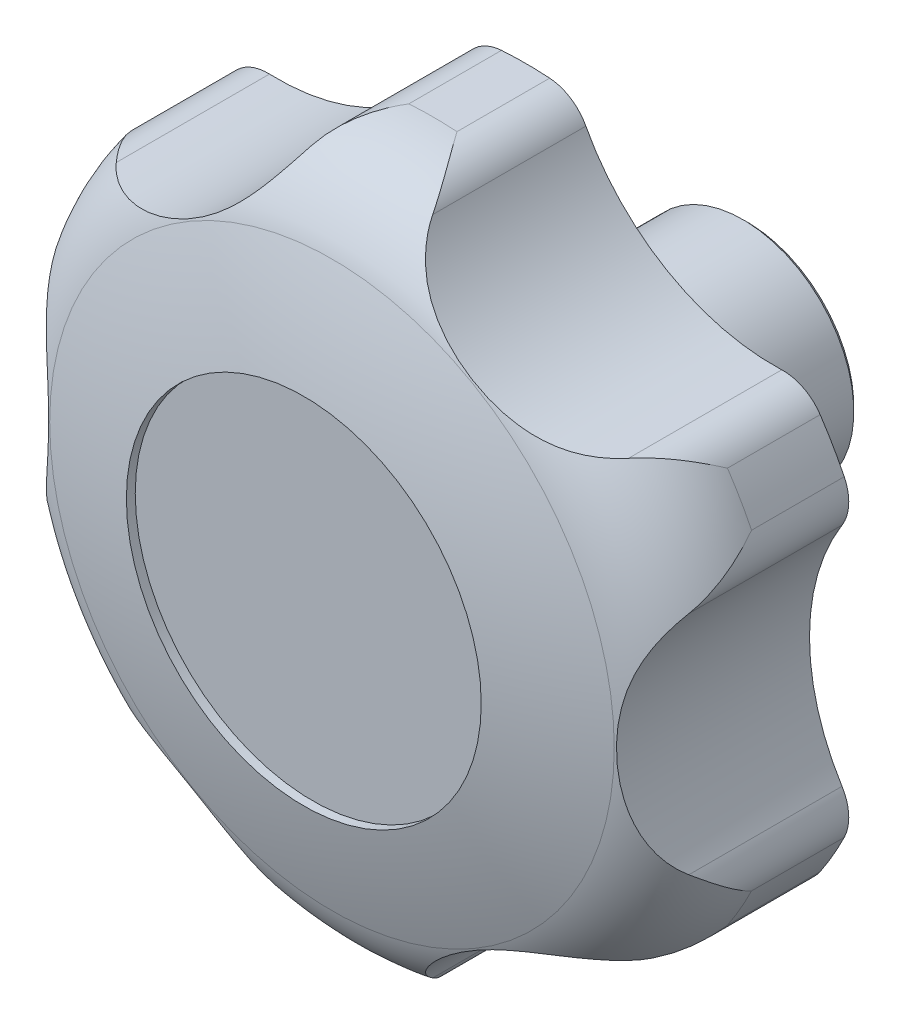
ISO-10303-21;
HEADER;
FILE_DESCRIPTION(('STEP AP214'),'2;1');
FILE_NAME('part.step','',(''),(''),'','','');
FILE_SCHEMA(('AUTOMOTIVE_DESIGN { 1 0 10303 214 1 1 1 1 }'));
ENDSEC;
DATA;
#1=APPLICATION_CONTEXT('core data for automotive mechanical design processes');
#2=APPLICATION_PROTOCOL_DEFINITION('international standard','automotive_design',2000,#1);
#3=PRODUCT_CONTEXT('',#1,'mechanical');
#4=PRODUCT('Part','Part','',(#3));
#5=PRODUCT_RELATED_PRODUCT_CATEGORY('part','',(#4));
#6=PRODUCT_DEFINITION_FORMATION('','',#4);
#7=PRODUCT_DEFINITION_CONTEXT('part definition',#1,'design');
#8=PRODUCT_DEFINITION('design','',#6,#7);
#9=PRODUCT_DEFINITION_SHAPE('','',#8);
#10=(LENGTH_UNIT() NAMED_UNIT(*) SI_UNIT(.MILLI.,.METRE.));
#11=(NAMED_UNIT(*) PLANE_ANGLE_UNIT() SI_UNIT($,.RADIAN.));
#12=(NAMED_UNIT(*) SI_UNIT($,.STERADIAN.) SOLID_ANGLE_UNIT());
#13=UNCERTAINTY_MEASURE_WITH_UNIT(LENGTH_MEASURE(1.E-05),#10,'distance_accuracy_value','');
#14=(GEOMETRIC_REPRESENTATION_CONTEXT(3) GLOBAL_UNCERTAINTY_ASSIGNED_CONTEXT((#13)) GLOBAL_UNIT_ASSIGNED_CONTEXT((#10,
#11,#12)) REPRESENTATION_CONTEXT('',''));
#15=CARTESIAN_POINT('',(0.,0.,0.));
#16=DIRECTION('',(0.,0.,1.));
#17=DIRECTION('',(1.,0.,0.));
#18=AXIS2_PLACEMENT_3D('',#15,#16,#17);
#19=CARTESIAN_POINT('',(0.,0.,64.59576815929));
#20=DIRECTION('',(0.,0.,1.));
#21=DIRECTION('',(-1.,0.,0.));
#22=AXIS2_PLACEMENT_3D('',#19,#20,#21);
#23=CYLINDRICAL_SURFACE('',#22,40.);
#24=CARTESIAN_POINT('',(0.,0.,25.));
#25=DIRECTION('',(0.,0.,1.));
#26=DIRECTION('',(-1.,0.,0.));
#27=AXIS2_PLACEMENT_3D('',#24,#25,#26);
#28=CIRCLE('',#27,40.);
#29=CARTESIAN_POINT('',(33.2039586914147,-22.3046436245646,25.));
#30=VERTEX_POINT('',#29);
#31=CARTESIAN_POINT('',(35.9183673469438,-17.603149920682,25.));
#32=VERTEX_POINT('',#31);
#33=EDGE_CURVE('E456',#30,#32,#28,.T.);
#34=ORIENTED_EDGE('',*,*,#33,.T.);
#35=DIRECTION('',(0.,0.,1.));
#36=VECTOR('',#35,1.);
#37=CARTESIAN_POINT('',(35.9183673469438,-17.603149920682,0.));
#38=LINE('',#37,#36);
#39=CARTESIAN_POINT('',(35.9183673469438,-17.603149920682,35.4470247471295));
#40=VERTEX_POINT('',#39);
#41=EDGE_CURVE('E182',#32,#40,#38,.T.);
#42=ORIENTED_EDGE('',*,*,#41,.T.);
#43=CARTESIAN_POINT('',(0.,0.,35.4470247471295));
#44=DIRECTION('',(0.,0.,1.));
#45=DIRECTION('',(-1.,0.,0.));
#46=AXIS2_PLACEMENT_3D('',#43,#44,#45);
#47=CIRCLE('',#46,40.);
#48=CARTESIAN_POINT('',(33.2039586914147,-22.3046436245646,35.4470247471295));
#49=VERTEX_POINT('',#48);
#50=EDGE_CURVE('E198',#49,#40,#47,.T.);
#51=ORIENTED_EDGE('',*,*,#50,.F.);
#52=DIRECTION('',(0.,0.,1.));
#53=VECTOR('',#52,1.);
#54=CARTESIAN_POINT('',(33.2039586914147,-22.3046436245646,0.));
#55=LINE('',#54,#53);
#56=EDGE_CURVE('E525',#30,#49,#55,.T.);
#57=ORIENTED_EDGE('',*,*,#56,.F.);
#58=EDGE_LOOP('',(#34,#42,#51,#57));
#59=FACE_BOUND('',#58,.T.);
#60=ADVANCED_FACE('F14',(#59),#23,.T.);
#61=CARTESIAN_POINT('',(-2.71440865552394,-39.9077935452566,25.));
#62=VERTEX_POINT('',#61);
#63=CARTESIAN_POINT('',(2.71440865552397,-39.9077935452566,25.));
#64=VERTEX_POINT('',#63);
#65=EDGE_CURVE('E459',#62,#64,#28,.T.);
#66=ORIENTED_EDGE('',*,*,#65,.T.);
#67=DIRECTION('',(0.,0.,1.));
#68=VECTOR('',#67,1.);
#69=CARTESIAN_POINT('',(2.71440865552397,-39.9077935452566,0.));
#70=LINE('',#69,#68);
#71=CARTESIAN_POINT('',(2.71440865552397,-39.9077935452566,35.4470247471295));
#72=VERTEX_POINT('',#71);
#73=EDGE_CURVE('E531',#64,#72,#70,.T.);
#74=ORIENTED_EDGE('',*,*,#73,.T.);
#75=CARTESIAN_POINT('',(-2.71440865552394,-39.9077935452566,35.4470247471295));
#76=VERTEX_POINT('',#75);
#77=EDGE_CURVE('E473',#76,#72,#47,.T.);
#78=ORIENTED_EDGE('',*,*,#77,.F.);
#79=DIRECTION('',(0.,0.,1.));
#80=VECTOR('',#79,1.);
#81=CARTESIAN_POINT('',(-2.71440865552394,-39.9077935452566,0.));
#82=LINE('',#81,#80);
#83=EDGE_CURVE('E534',#62,#76,#82,.T.);
#84=ORIENTED_EDGE('',*,*,#83,.F.);
#85=EDGE_LOOP('',(#66,#74,#78,#84));
#86=FACE_BOUND('',#85,.T.);
#87=ADVANCED_FACE('F422',(#86),#23,.T.);
#88=CARTESIAN_POINT('',(-35.9183673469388,-17.603149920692,25.));
#89=VERTEX_POINT('',#88);
#90=CARTESIAN_POINT('',(-33.2039586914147,-22.3046436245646,25.));
#91=VERTEX_POINT('',#90);
#92=EDGE_CURVE('E462',#89,#91,#28,.T.);
#93=ORIENTED_EDGE('',*,*,#92,.T.);
#94=DIRECTION('',(0.,0.,1.));
#95=VECTOR('',#94,1.);
#96=CARTESIAN_POINT('',(-33.2039586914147,-22.3046436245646,0.));
#97=LINE('',#96,#95);
#98=CARTESIAN_POINT('',(-33.2039586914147,-22.3046436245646,35.4470247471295));
#99=VERTEX_POINT('',#98);
#100=EDGE_CURVE('E542',#91,#99,#97,.T.);
#101=ORIENTED_EDGE('',*,*,#100,.T.);
#102=CARTESIAN_POINT('',(-35.9183673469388,-17.603149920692,35.4470247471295));
#103=VERTEX_POINT('',#102);
#104=EDGE_CURVE('E469',#103,#99,#47,.T.);
#105=ORIENTED_EDGE('',*,*,#104,.F.);
#106=DIRECTION('',(0.,0.,1.));
#107=VECTOR('',#106,1.);
#108=CARTESIAN_POINT('',(-35.9183673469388,-17.603149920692,0.));
#109=LINE('',#108,#107);
#110=EDGE_CURVE('E545',#89,#103,#109,.T.);
#111=ORIENTED_EDGE('',*,*,#110,.F.);
#112=EDGE_LOOP('',(#93,#101,#105,#111));
#113=FACE_BOUND('',#112,.T.);
#114=ADVANCED_FACE('F430',(#113),#23,.T.);
#115=CARTESIAN_POINT('',(-33.2039586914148,22.3046436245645,25.));
#116=VERTEX_POINT('',#115);
#117=CARTESIAN_POINT('',(-35.9183673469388,17.603149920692,25.));
#118=VERTEX_POINT('',#117);
#119=EDGE_CURVE('E461',#116,#118,#28,.T.);
#120=ORIENTED_EDGE('',*,*,#119,.T.);
#121=DIRECTION('',(0.,0.,1.));
#122=VECTOR('',#121,1.);
#123=CARTESIAN_POINT('',(-35.9183673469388,17.603149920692,0.));
#124=LINE('',#123,#122);
#125=CARTESIAN_POINT('',(-35.9183673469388,17.603149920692,35.4470247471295));
#126=VERTEX_POINT('',#125);
#127=EDGE_CURVE('E37',#118,#126,#124,.T.);
#128=ORIENTED_EDGE('',*,*,#127,.T.);
#129=CARTESIAN_POINT('',(-33.2039586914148,22.3046436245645,35.4470247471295));
#130=VERTEX_POINT('',#129);
#131=EDGE_CURVE('E466',#130,#126,#47,.T.);
#132=ORIENTED_EDGE('',*,*,#131,.F.);
#133=DIRECTION('',(0.,0.,1.));
#134=VECTOR('',#133,1.);
#135=CARTESIAN_POINT('',(-33.2039586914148,22.3046436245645,0.));
#136=LINE('',#135,#134);
#137=EDGE_CURVE('E554',#116,#130,#136,.T.);
#138=ORIENTED_EDGE('',*,*,#137,.F.);
#139=EDGE_LOOP('',(#120,#128,#132,#138));
#140=FACE_BOUND('',#139,.T.);
#141=ADVANCED_FACE('F443',(#140),#23,.T.);
#142=CARTESIAN_POINT('',(2.71440865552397,39.9077935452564,25.));
#143=VERTEX_POINT('',#142);
#144=CARTESIAN_POINT('',(-2.714408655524,39.9077935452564,25.));
#145=VERTEX_POINT('',#144);
#146=EDGE_CURVE('E457',#143,#145,#28,.T.);
#147=ORIENTED_EDGE('',*,*,#146,.T.);
#148=DIRECTION('',(0.,0.,1.));
#149=VECTOR('',#148,1.);
#150=CARTESIAN_POINT('',(-2.714408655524,39.9077935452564,0.));
#151=LINE('',#150,#149);
#152=CARTESIAN_POINT('',(-2.714408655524,39.9077935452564,35.4470247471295));
#153=VERTEX_POINT('',#152);
#154=EDGE_CURVE('E562',#145,#153,#151,.T.);
#155=ORIENTED_EDGE('',*,*,#154,.T.);
#156=CARTESIAN_POINT('',(2.71440865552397,39.9077935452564,35.4470247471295));
#157=VERTEX_POINT('',#156);
#158=EDGE_CURVE('E861',#157,#153,#47,.T.);
#159=ORIENTED_EDGE('',*,*,#158,.F.);
#160=DIRECTION('',(0.,0.,1.));
#161=VECTOR('',#160,1.);
#162=CARTESIAN_POINT('',(2.71440865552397,39.9077935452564,0.));
#163=LINE('',#162,#161);
#164=EDGE_CURVE('E565',#143,#157,#163,.T.);
#165=ORIENTED_EDGE('',*,*,#164,.F.);
#166=EDGE_LOOP('',(#147,#155,#159,#165));
#167=FACE_BOUND('',#166,.T.);
#168=ADVANCED_FACE('F434',(#167),#23,.T.);
#169=CARTESIAN_POINT('',(35.9183673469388,17.603149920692,25.));
#170=VERTEX_POINT('',#169);
#171=CARTESIAN_POINT('',(33.2039586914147,22.3046436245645,25.));
#172=VERTEX_POINT('',#171);
#173=EDGE_CURVE('E449',#170,#172,#28,.T.);
#174=ORIENTED_EDGE('',*,*,#173,.T.);
#175=DIRECTION('',(0.,0.,1.));
#176=VECTOR('',#175,1.);
#177=CARTESIAN_POINT('',(33.2039586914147,22.3046436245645,0.));
#178=LINE('',#177,#176);
#179=CARTESIAN_POINT('',(33.2039586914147,22.3046436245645,35.4470247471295));
#180=VERTEX_POINT('',#179);
#181=EDGE_CURVE('E451',#172,#180,#178,.T.);
#182=ORIENTED_EDGE('',*,*,#181,.T.);
#183=CARTESIAN_POINT('',(35.9183673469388,17.603149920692,35.4470247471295));
#184=VERTEX_POINT('',#183);
#185=EDGE_CURVE('E863',#184,#180,#47,.T.);
#186=ORIENTED_EDGE('',*,*,#185,.F.);
#187=DIRECTION('',(0.,0.,1.));
#188=VECTOR('',#187,1.);
#189=CARTESIAN_POINT('',(35.9183673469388,17.603149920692,0.));
#190=LINE('',#189,#188);
#191=EDGE_CURVE('E453',#170,#184,#190,.T.);
#192=ORIENTED_EDGE('',*,*,#191,.F.);
#193=EDGE_LOOP('',(#174,#182,#186,#192));
#194=FACE_BOUND('',#193,.T.);
#195=ADVANCED_FACE('F424',(#194),#23,.T.);
#196=CARTESIAN_POINT('',(0.,0.,0.));
#197=DIRECTION('',(0.,0.,1.));
#198=DIRECTION('',(-1.,0.,0.));
#199=AXIS2_PLACEMENT_3D('',#196,#197,#198);
#200=CONICAL_SURFACE('',#199,12.,0.785398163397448);
#201=CARTESIAN_POINT('',(0.,0.,0.5));
#202=DIRECTION('',(0.,0.,1.));
#203=DIRECTION('',(-1.,0.,0.));
#204=AXIS2_PLACEMENT_3D('',#201,#202,#203);
#205=CIRCLE('',#204,12.5);
#206=CARTESIAN_POINT('',(-12.5,0.,0.5));
#207=VERTEX_POINT('',#206);
#208=EDGE_CURVE('E842',#207,#207,#205,.T.);
#209=ORIENTED_EDGE('',*,*,#208,.F.);
#210=EDGE_LOOP('',(#209));
#211=FACE_BOUND('',#210,.T.);
#212=CARTESIAN_POINT('',(0.,0.,0.));
#213=DIRECTION('',(0.,0.,1.));
#214=DIRECTION('',(-1.,0.,0.));
#215=AXIS2_PLACEMENT_3D('',#212,#213,#214);
#216=CIRCLE('',#215,12.);
#217=CARTESIAN_POINT('',(-12.,0.,0.));
#218=VERTEX_POINT('',#217);
#219=EDGE_CURVE('E476',#218,#218,#216,.T.);
#220=ORIENTED_EDGE('',*,*,#219,.T.);
#221=EDGE_LOOP('',(#220));
#222=FACE_BOUND('',#221,.T.);
#223=ADVANCED_FACE('F16',(#211,#222),#200,.T.);
#224=CARTESIAN_POINT('',(0.,-1.94289029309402E-13,0.));
#225=DIRECTION('',(0.,0.,1.));
#226=DIRECTION('',(-1.,0.,0.));
#227=AXIS2_PLACEMENT_3D('',#224,#225,#226);
#228=PLANE('',#227);
#229=CARTESIAN_POINT('',(0.,0.,0.));
#230=DIRECTION('',(0.,0.,-1.));
#231=DIRECTION('',(1.,0.,0.));
#232=AXIS2_PLACEMENT_3D('',#229,#230,#231);
#233=CIRCLE('',#232,8.);
#234=CARTESIAN_POINT('',(8.,0.,0.));
#235=VERTEX_POINT('',#234);
#236=EDGE_CURVE('E191',#235,#235,#233,.T.);
#237=ORIENTED_EDGE('',*,*,#236,.F.);
#238=EDGE_LOOP('',(#237));
#239=FACE_BOUND('',#238,.T.);
#240=ORIENTED_EDGE('',*,*,#219,.F.);
#241=EDGE_LOOP('',(#240));
#242=FACE_BOUND('',#241,.T.);
#243=ADVANCED_FACE('F441',(#239,#242),#228,.F.);
#244=CARTESIAN_POINT('',(0.,0.,-47.979589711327));
#245=DIRECTION('',(-1.,0.,0.));
#246=DIRECTION('',(0.,0.,-1.));
#247=AXIS2_PLACEMENT_3D('',#244,#245,#246);
#248=SPHERICAL_SURFACE('',#247,100.);
#249=CARTESIAN_POINT('',(0.,0.,-47.979589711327));
#250=DIRECTION('',(0.,0.,1.));
#251=DIRECTION('',(-1.,0.,0.));
#252=AXIS2_PLACEMENT_3D('',#249,#250,#251);
#253=SPHERICAL_SURFACE('',#252,100.);
#254=CARTESIAN_POINT('',(0.,0.,46.823381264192));
#255=DIRECTION('',(0.,0.,1.));
#256=DIRECTION('',(-1.,0.,0.));
#257=AXIS2_PLACEMENT_3D('',#254,#255,#256);
#258=CIRCLE('',#257,31.8181818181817);
#259=CARTESIAN_POINT('',(-31.8181818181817,0.,46.823381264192));
#260=VERTEX_POINT('',#259);
#261=EDGE_CURVE('E472',#260,#260,#258,.T.);
#262=ORIENTED_EDGE('',*,*,#261,.T.);
#263=EDGE_LOOP('',(#262));
#264=FACE_BOUND('',#263,.T.);
#265=CARTESIAN_POINT('',(0.,0.,50.));
#266=DIRECTION('',(0.,0.,1.));
#267=DIRECTION('',(-1.,0.,0.));
#268=AXIS2_PLACEMENT_3D('',#265,#266,#267);
#269=CIRCLE('',#268,20.);
#270=CARTESIAN_POINT('',(-20.,0.,50.));
#271=VERTEX_POINT('',#270);
#272=EDGE_CURVE('E199',#271,#271,#269,.T.);
#273=ORIENTED_EDGE('',*,*,#272,.F.);
#274=EDGE_LOOP('',(#273));
#275=FACE_BOUND('',#274,.T.);
#276=ADVANCED_FACE('F590',(#264,#275),#253,.T.);
#277=CARTESIAN_POINT('',(0.,0.,35.44702474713));
#278=DIRECTION('',(0.,0.,1.));
#279=DIRECTION('',(-1.,0.,0.));
#280=AXIS2_PLACEMENT_3D('',#277,#278,#279);
#281=TOROIDAL_SURFACE('',#280,28.,12.);
#282=CARTESIAN_POINT('',(33.2039586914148,-22.3046436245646,35.44702474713));
#283=CARTESIAN_POINT('',(33.2016458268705,-22.3080866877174,35.4530354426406));
#284=CARTESIAN_POINT('',(33.1993286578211,-22.3115269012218,35.4590461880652));
#285=CARTESIAN_POINT('',(33.0621842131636,-22.5145941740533,35.8141433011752));
#286=CARTESIAN_POINT('',(32.9128604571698,-22.7045847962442,36.1633854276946));
#287=CARTESIAN_POINT('',(32.5872275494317,-23.062127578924,36.860845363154));
#288=CARTESIAN_POINT('',(32.4109089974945,-23.2296718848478,37.2090627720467));
#289=CARTESIAN_POINT('',(32.0328927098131,-23.5393466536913,37.9038529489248));
#290=CARTESIAN_POINT('',(31.8311572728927,-23.6814385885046,38.2504224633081));
#291=CARTESIAN_POINT('',(31.4045582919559,-23.9362981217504,38.9399718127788));
#292=CARTESIAN_POINT('',(31.1797053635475,-24.0490790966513,39.2829532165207));
#293=CARTESIAN_POINT('',(30.7879651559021,-24.2091174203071,39.8497011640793));
#294=CARTESIAN_POINT('',(30.6268988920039,-24.2656677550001,40.0749071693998));
#295=CARTESIAN_POINT('',(30.2963113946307,-24.3626945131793,40.5224669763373));
#296=CARTESIAN_POINT('',(30.1267933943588,-24.4031770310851,40.744821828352));
#297=CARTESIAN_POINT('',(29.7801340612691,-24.466615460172,41.1860795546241));
#298=CARTESIAN_POINT('',(29.6029933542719,-24.4895728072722,41.4049827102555));
#299=CARTESIAN_POINT('',(29.2420201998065,-24.5162777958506,41.8387209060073));
#300=CARTESIAN_POINT('',(29.0581817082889,-24.5200076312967,42.0535519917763));
#301=CARTESIAN_POINT('',(28.8716321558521,-24.5132558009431,42.2658258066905));
#302=B_SPLINE_CURVE_WITH_KNOTS('',3,(#282,#283,#284,#285,#286,#287,#288,#289,#290,#291,#292,
#293,#294,#295,#296,#297,#298,#299,#300,#301),.UNSPECIFIED.,.F.,.F.,(4,2,2,2,2,2,2,2,2,4),(0.,
0.0219089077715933,1.29430371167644,2.5671426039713,3.84189224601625,5.11605911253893,
5.96330602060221,6.8102312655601,7.65708711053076,8.50472706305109),.UNSPECIFIED.);
#303=CARTESIAN_POINT('',(28.8718321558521,-24.5132630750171,42.2655982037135));
#304=VERTEX_POINT('',#303);
#305=EDGE_CURVE('E200',#49,#304,#302,.T.);
#306=ORIENTED_EDGE('',*,*,#305,.F.);
#307=ORIENTED_EDGE('',*,*,#50,.T.);
#308=CARTESIAN_POINT('',(35.6648992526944,-12.7469085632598,42.2658666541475));
#309=CARTESIAN_POINT('',(35.7234532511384,-12.8403174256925,42.1404930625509));
#310=CARTESIAN_POINT('',(35.7783600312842,-12.9347527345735,42.0142254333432));
#311=CARTESIAN_POINT('',(35.8810719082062,-13.1252663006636,41.7600922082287));
#312=CARTESIAN_POINT('',(35.9288784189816,-13.2213442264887,41.6322269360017));
#313=CARTESIAN_POINT('',(36.0618532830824,-13.5112308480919,41.2467805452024));
#314=CARTESIAN_POINT('',(36.1367290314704,-13.7069387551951,40.9870200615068));
#315=CARTESIAN_POINT('',(36.2603267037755,-14.1002303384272,40.4635033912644));
#316=CARTESIAN_POINT('',(36.3090884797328,-14.2978106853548,40.1997539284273));
#317=CARTESIAN_POINT('',(36.3820057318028,-14.6929287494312,39.6687368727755));
#318=CARTESIAN_POINT('',(36.4061527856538,-14.8904664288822,39.4014681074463));
#319=CARTESIAN_POINT('',(36.4325564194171,-15.3076554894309,38.8311912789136));
#320=CARTESIAN_POINT('',(36.4317470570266,-15.5270305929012,38.5278395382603));
#321=CARTESIAN_POINT('',(36.4021049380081,-15.9605923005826,37.9187847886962));
#322=CARTESIAN_POINT('',(36.3732684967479,-16.1747782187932,37.6130814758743));
#323=CARTESIAN_POINT('',(36.2889979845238,-16.5953080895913,37.0006549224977));
#324=CARTESIAN_POINT('',(36.2336026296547,-16.8016629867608,36.6939338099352));
#325=CARTESIAN_POINT('',(36.0974410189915,-17.2046623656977,36.079792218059));
#326=CARTESIAN_POINT('',(36.0166818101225,-17.4013095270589,35.7723719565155));
#327=CARTESIAN_POINT('',(35.9220134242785,-17.5956985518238,35.4590461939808));
#328=CARTESIAN_POINT('',(35.9201926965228,-17.5994253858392,35.453035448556));
#329=CARTESIAN_POINT('',(35.9183673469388,-17.603149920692,35.44702474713));
#330=B_SPLINE_CURVE_WITH_KNOTS('',3,(#308,#309,#310,#311,#312,#313,#314,#315,#316,#317,#318,
#319,#320,#321,#322,#323,#324,#325,#326,#327,#328,#329),.UNSPECIFIED.,.F.,.F.,(4,2,2,2,2,2,2,2,
2,2,4),(0.,0.50074643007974,1.0013930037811,2.0013764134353,2.99982938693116,3.99862388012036,
5.12056047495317,6.24264458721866,7.36309793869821,8.48324026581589,8.50514917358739),.UNSPECIFIED.);
#331=CARTESIAN_POINT('',(35.6650246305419,-12.7471085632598,42.2655982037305));
#332=VERTEX_POINT('',#331);
#333=EDGE_CURVE('E186',#332,#40,#330,.T.);
#334=ORIENTED_EDGE('',*,*,#333,.F.);
#335=CARTESIAN_POINT('',(35.6651500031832,-12.7473085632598,42.2653297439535));
#336=CARTESIAN_POINT('',(35.6085788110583,-12.657064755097,42.3864729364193));
#337=CARTESIAN_POINT('',(35.5511259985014,-12.5640789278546,42.505127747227));
#338=CARTESIAN_POINT('',(35.4348010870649,-12.372757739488,42.7373042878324));
#339=CARTESIAN_POINT('',(35.3759290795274,-12.2744227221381,42.8508263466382));
#340=CARTESIAN_POINT('',(35.1978187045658,-11.9717980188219,43.183239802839));
#341=CARTESIAN_POINT('',(35.0769610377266,-11.759691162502,43.3942434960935));
#342=CARTESIAN_POINT('',(34.8351019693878,-11.3185575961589,43.7921481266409));
#343=CARTESIAN_POINT('',(34.7141137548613,-11.0897185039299,43.9792663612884));
#344=CARTESIAN_POINT('',(34.4734853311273,-10.6150811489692,44.3316300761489));
#345=CARTESIAN_POINT('',(34.3538453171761,-10.3692804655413,44.4968724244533));
#346=CARTESIAN_POINT('',(34.118747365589,-9.86348535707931,44.8053655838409));
#347=CARTESIAN_POINT('',(34.003278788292,-9.60353201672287,44.9486758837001));
#348=CARTESIAN_POINT('',(33.7783302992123,-9.0708864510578,45.2147402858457));
#349=CARTESIAN_POINT('',(33.6688502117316,-8.79819459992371,45.3374949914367));
#350=CARTESIAN_POINT('',(33.4574270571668,-8.2414359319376,45.5640287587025));
#351=CARTESIAN_POINT('',(33.355501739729,-7.95734460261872,45.6677639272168));
#352=CARTESIAN_POINT('',(33.1608918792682,-7.3802416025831,45.8575354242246));
#353=CARTESIAN_POINT('',(33.0682085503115,-7.08722876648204,45.9435694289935));
#354=CARTESIAN_POINT('',(32.8468004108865,-6.33664057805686,46.1411058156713));
#355=CARTESIAN_POINT('',(32.7250175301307,-5.87417592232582,46.2419297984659));
#356=CARTESIAN_POINT('',(32.5084193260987,-4.93732591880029,46.4126100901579));
#357=CARTESIAN_POINT('',(32.4136174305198,-4.46293476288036,46.4824509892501));
#358=CARTESIAN_POINT('',(32.2523910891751,-3.50533052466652,46.5968256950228));
#359=CARTESIAN_POINT('',(32.1860288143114,-3.02210049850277,46.6413041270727));
#360=CARTESIAN_POINT('',(32.0828256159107,-2.05113738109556,46.7089202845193));
#361=CARTESIAN_POINT('',(32.0459807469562,-1.56340490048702,46.7320608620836));
#362=CARTESIAN_POINT('',(32.0014874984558,-0.570823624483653,46.7598837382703));
#363=CARTESIAN_POINT('',(31.9947863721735,-0.0659157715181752,46.7639673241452));
#364=CARTESIAN_POINT('',(32.0132306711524,0.943168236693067,46.7525345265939));
#365=CARTESIAN_POINT('',(32.0383802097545,1.44734428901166,46.7370156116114));
#366=CARTESIAN_POINT('',(32.1202170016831,2.45139648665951,46.6846206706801));
#367=CARTESIAN_POINT('',(32.1768642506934,2.95127727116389,46.647771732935));
#368=CARTESIAN_POINT('',(32.3209795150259,3.94402208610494,46.5488585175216));
#369=CARTESIAN_POINT('',(32.4084384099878,4.43688814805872,46.4868017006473));
#370=CARTESIAN_POINT('',(32.5883264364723,5.29501706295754,46.3503630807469));
#371=CARTESIAN_POINT('',(32.6745687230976,5.66261664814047,46.2824745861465));
#372=CARTESIAN_POINT('',(32.8630501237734,6.38923539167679,46.1258564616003));
#373=CARTESIAN_POINT('',(32.9652885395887,6.74825492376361,46.0371277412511));
#374=CARTESIAN_POINT('',(33.1840934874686,7.45459097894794,45.8358574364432));
#375=CARTESIAN_POINT('',(33.3006411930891,7.80192212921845,45.7233470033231));
#376=CARTESIAN_POINT('',(33.5459960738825,8.48223685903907,45.4714791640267));
#377=CARTESIAN_POINT('',(33.6748001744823,8.81522400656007,45.3321284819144));
#378=CARTESIAN_POINT('',(33.9165908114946,9.40234329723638,45.0531451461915));
#379=CARTESIAN_POINT('',(34.0279848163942,9.65951147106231,44.9185129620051));
#380=CARTESIAN_POINT('',(34.2549904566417,10.1602198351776,44.6290220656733));
#381=CARTESIAN_POINT('',(34.3706011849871,10.4037629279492,44.474167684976));
#382=CARTESIAN_POINT('',(34.6036653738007,10.8750119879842,44.1439922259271));
#383=CARTESIAN_POINT('',(34.7211158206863,11.1027410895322,43.9687020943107));
#384=CARTESIAN_POINT('',(34.9555495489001,11.5409190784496,43.5975963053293));
#385=CARTESIAN_POINT('',(35.0725330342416,11.7513765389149,43.4017909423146));
#386=CARTESIAN_POINT('',(35.2696517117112,12.0946088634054,43.0505692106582));
#387=CARTESIAN_POINT('',(35.3505397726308,12.2320760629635,42.9001303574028));
#388=CARTESIAN_POINT('',(35.509879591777,12.4971557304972,42.5897662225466));
#389=CARTESIAN_POINT('',(35.5883327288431,12.6247738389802,42.4298464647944));
#390=CARTESIAN_POINT('',(35.6651500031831,12.7473085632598,42.2653297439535));
#391=B_SPLINE_CURVE_WITH_KNOTS('',3,(#335,#336,#337,#338,#339,#340,#341,#342,#343,#344,#345,
#346,#347,#348,#349,#350,#351,#352,#353,#354,#355,#356,#357,#358,#359,#360,#361,#362,#363,#364,
#365,#366,#367,#368,#369,#370,#371,#372,#373,#374,#375,#376,#377,#378,#379,#380,#381,#382,#383,
#384,#385,#386,#387,#388,#389,#390),.UNSPECIFIED.,.F.,.F.,(4,2,2,2,2,2,2,2,2,2,2,2,2,2,2,2,2,2,
2,2,2,2,2,2,2,2,2,4),(0.,0.483826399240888,0.967621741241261,1.93415653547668,2.89115364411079,
3.84828761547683,4.80277758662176,5.75723953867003,6.71387720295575,7.67064037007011,
9.13462899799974,10.5993449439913,12.0672467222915,13.5349522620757,15.0484714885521,
16.5621861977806,18.0739827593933,19.5853321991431,20.7353651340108,21.8853478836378,
23.03383351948,24.1820318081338,25.1138844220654,26.0455377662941,26.9757981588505,
27.905593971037,28.5629371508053,29.2199010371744),.UNSPECIFIED.);
#392=CARTESIAN_POINT('',(35.6650246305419,12.7471085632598,42.2655982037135));
#393=VERTEX_POINT('',#392);
#394=EDGE_CURVE('E174',#332,#393,#391,.T.);
#395=ORIENTED_EDGE('',*,*,#394,.T.);
#396=CARTESIAN_POINT('',(35.9183673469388,17.603149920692,35.44702474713));
#397=CARTESIAN_POINT('',(35.9201926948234,17.5994253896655,35.4530354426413));
#398=CARTESIAN_POINT('',(35.9220134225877,17.5956985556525,35.4590461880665));
#399=CARTESIAN_POINT('',(36.0293026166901,17.375394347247,35.8141432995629));
#400=CARTESIAN_POINT('',(36.1191774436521,17.1510808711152,36.1633854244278));
#401=CARTESIAN_POINT('',(36.2660021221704,16.6903031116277,36.8608453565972));
#402=CARTESIAN_POINT('',(36.322940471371,16.4538346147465,37.2090627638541));
#403=CARTESIAN_POINT('',(36.4021185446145,15.9716255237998,37.9038529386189));
#404=CARTESIAN_POINT('',(36.4243060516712,15.7258715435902,38.2504224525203));
#405=CARTESIAN_POINT('',(36.4317213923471,15.2289962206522,38.9399718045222));
#406=CARTESIAN_POINT('',(36.4169661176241,14.977877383,39.2829532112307));
#407=CARTESIAN_POINT('',(36.3596929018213,14.5585985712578,39.8497047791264));
#408=CARTESIAN_POINT('',(36.3281331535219,14.390833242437,40.0749143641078));
#409=CARTESIAN_POINT('',(36.2468651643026,14.0560173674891,40.5224812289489));
#410=CARTESIAN_POINT('',(36.1971638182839,13.8889665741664,40.7448395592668));
#411=CARTESIAN_POINT('',(36.0787703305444,13.5570263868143,41.1861041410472));
#412=CARTESIAN_POINT('',(36.0100797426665,13.3921368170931,41.4050106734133));
#413=CARTESIAN_POINT('',(35.8527159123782,13.0661675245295,41.8387554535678));
#414=CARTESIAN_POINT('',(35.764024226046,12.9050914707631,42.0535897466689));
#415=CARTESIAN_POINT('',(35.6648992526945,12.7469085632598,42.2658666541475));
#416=B_SPLINE_CURVE_WITH_KNOTS('',3,(#396,#397,#398,#399,#400,#401,#402,#403,#404,#405,#406,
#407,#408,#409,#410,#411,#412,#413,#414,#415),.UNSPECIFIED.,.F.,.F.,(4,2,2,2,2,2,2,2,2,4),(0.,
0.0219089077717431,1.29430370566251,2.56714259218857,3.84189223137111,5.11605911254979,
5.96331954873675,6.81025830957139,7.6571277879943,8.50478141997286),.UNSPECIFIED.);
#417=EDGE_CURVE('E181',#184,#393,#416,.T.);
#418=ORIENTED_EDGE('',*,*,#417,.F.);
#419=ORIENTED_EDGE('',*,*,#185,.T.);
#420=CARTESIAN_POINT('',(28.8716321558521,24.5132558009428,42.2658258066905));
#421=CARTESIAN_POINT('',(28.9818038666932,24.5172598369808,42.1404514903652));
#422=CARTESIAN_POINT('',(29.0910408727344,24.5175920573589,42.0141831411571));
#423=CARTESIAN_POINT('',(29.3073868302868,24.5112847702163,41.7600484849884));
#424=CARTESIAN_POINT('',(29.4144962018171,24.5046466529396,41.6321825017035));
#425=CARTESIAN_POINT('',(29.7320333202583,24.4748605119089,41.2467339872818));
#426=CARTESIAN_POINT('',(29.9389594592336,24.4418492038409,40.9869721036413));
#427=CARTESIAN_POINT('',(30.34135909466,24.3522387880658,40.4634526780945));
#428=CARTESIAN_POINT('',(30.5368496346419,24.2956758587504,40.1997018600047));
#429=CARTESIAN_POINT('',(30.9154904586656,24.1612616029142,39.6686821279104));
#430=CARTESIAN_POINT('',(31.098636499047,24.083403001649,39.4014120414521));
#431=CARTESIAN_POINT('',(31.4731301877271,23.8976729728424,38.8311384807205));
#432=CARTESIAN_POINT('',(31.6627059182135,23.7872849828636,38.5277913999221));
#433=CARTESIAN_POINT('',(32.0233528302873,23.5448350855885,37.9187460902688));
#434=CARTESIAN_POINT('',(32.1944215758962,23.4127703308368,37.6130475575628));
#435=CARTESIAN_POINT('',(32.5164695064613,23.1295282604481,37.0006306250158));
#436=CARTESIAN_POINT('',(32.6674775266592,22.9783790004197,36.6939143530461));
#437=CARTESIAN_POINT('',(32.948399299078,22.6589644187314,36.079782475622));
#438=CARTESIAN_POINT('',(33.0783188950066,22.4907038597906,35.7723670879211));
#439=CARTESIAN_POINT('',(33.1993286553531,22.3115269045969,35.4590461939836));
#440=CARTESIAN_POINT('',(33.2016458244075,22.3080866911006,35.4530354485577));
#441=CARTESIAN_POINT('',(33.2039586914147,22.3046436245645,35.44702474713));
#442=B_SPLINE_CURVE_WITH_KNOTS('',3,(#420,#421,#422,#423,#424,#425,#426,#427,#428,#429,#430,
#431,#432,#433,#434,#435,#436,#437,#438,#439,#440,#441),.UNSPECIFIED.,.F.,.F.,(4,2,2,2,2,2,2,2,
2,2,4),(0.,0.500748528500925,1.00139720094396,2.00138482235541,2.99984196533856,3.9986406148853,
5.12055943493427,6.24262574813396,7.36306133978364,8.48318592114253,8.50509482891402),.UNSPECIFIED.);
#443=CARTESIAN_POINT('',(28.8718321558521,24.5132630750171,42.2655982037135));
#444=VERTEX_POINT('',#443);
#445=EDGE_CURVE('E250',#444,#180,#442,.T.);
#446=ORIENTED_EDGE('',*,*,#445,.F.);
#447=CARTESIAN_POINT('',(28.8720321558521,24.5132703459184,42.265370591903));
#448=CARTESIAN_POINT('',(28.7655922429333,24.509400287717,42.3865135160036));
#449=CARTESIAN_POINT('',(28.6563368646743,24.506137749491,42.505168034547));
#450=CARTESIAN_POINT('',(28.432483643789,24.5010583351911,42.7373439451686));
#451=CARTESIAN_POINT('',(28.3178861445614,24.4992413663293,42.8508656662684));
#452=CARTESIAN_POINT('',(27.9667476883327,24.4963061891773,43.1832780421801));
#453=CARTESIAN_POINT('',(27.7226272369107,24.4976942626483,43.3942809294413));
#454=CARTESIAN_POINT('',(27.2196615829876,24.5088059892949,43.7921837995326));
#455=CARTESIAN_POINT('',(26.9609854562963,24.5184472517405,43.9793010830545));
#456=CARTESIAN_POINT('',(26.4296202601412,24.5473768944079,44.3316628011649));
#457=CARTESIAN_POINT('',(26.1569291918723,24.5666666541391,44.4969041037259));
#458=CARTESIAN_POINT('',(25.6013461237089,24.6159649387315,44.8053951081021));
#459=CARTESIAN_POINT('',(25.3184843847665,24.6459437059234,44.9487043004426));
#460=CARTESIAN_POINT('',(24.7447231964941,24.7174571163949,45.2147664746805));
#461=CARTESIAN_POINT('',(24.4538239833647,24.7589914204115,45.3375200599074));
#462=CARTESIAN_POINT('',(23.8659431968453,24.8542748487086,45.5640516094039));
#463=CARTESIAN_POINT('',(23.5689492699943,24.9080516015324,45.6677856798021));
#464=CARTESIAN_POINT('',(22.9718567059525,25.0280680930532,45.8575550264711));
#465=CARTESIAN_POINT('',(22.6717576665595,25.0943094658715,45.9435879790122));
#466=CARTESIAN_POINT('',(21.9110220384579,25.2778615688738,46.1411221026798));
#467=CARTESIAN_POINT('',(21.4496222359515,25.4036289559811,46.2419448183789));
#468=CARTESIAN_POINT('',(20.5299830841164,25.6844789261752,46.4126226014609));
#469=CARTESIAN_POINT('',(20.0717454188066,25.8395760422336,46.482462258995));
#470=CARTESIAN_POINT('',(19.1618190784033,26.1787570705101,46.5968345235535));
#471=CARTESIAN_POINT('',(18.710146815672,26.3629032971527,46.6413117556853));
#472=CARTESIAN_POINT('',(17.8176634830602,26.7590137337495,46.7089255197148));
#473=CARTESIAN_POINT('',(17.3768509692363,26.9709742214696,46.7320649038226));
#474=CARTESIAN_POINT('',(16.4950014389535,27.4287384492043,46.7598852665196));
#475=CARTESIAN_POINT('',(16.0543869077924,27.6753920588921,46.7639675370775));
#476=CARTESIAN_POINT('',(15.1897151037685,28.1959134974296,46.7525318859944));
#477=CARTESIAN_POINT('',(14.7656599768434,28.4697848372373,46.7370114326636));
#478=CARTESIAN_POINT('',(13.9370427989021,29.0426900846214,46.684613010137));
#479=CARTESIAN_POINT('',(13.5324567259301,29.3416916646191,46.6477621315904));
#480=CARTESIAN_POINT('',(12.7447720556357,29.9628780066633,46.5488444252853));
#481=CARTESIAN_POINT('',(12.3616671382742,30.2850558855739,46.4867850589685));
#482=CARTESIAN_POINT('',(11.7084538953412,30.8699103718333,46.3503419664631));
#483=CARTESIAN_POINT('',(11.4332282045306,31.128397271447,46.2824519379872));
#484=CARTESIAN_POINT('',(10.8982060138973,31.6549341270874,46.1258307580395));
#485=CARTESIAN_POINT('',(10.6384088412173,31.9229836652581,46.0371005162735));
#486=CARTESIAN_POINT('',(10.1361135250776,32.4656393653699,45.8358272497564));
#487=CARTESIAN_POINT('',(9.89359330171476,32.7402365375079,45.723315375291));
#488=CARTESIAN_POINT('',(9.42710779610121,33.2928737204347,45.4714448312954));
#489=CARTESIAN_POINT('',(9.2031378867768,33.5709128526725,45.3320928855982));
#490=CARTESIAN_POINT('',(8.81557789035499,34.0738665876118,45.0531067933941));
#491=CARTESIAN_POINT('',(8.64856236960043,34.2989200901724,44.9184729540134));
#492=CARTESIAN_POINT('',(8.32844232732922,34.7458654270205,44.6289787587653));
#493=CARTESIAN_POINT('',(8.17533483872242,34.9677579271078,44.4741227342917));
#494=CARTESIAN_POINT('',(7.88375656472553,35.4052199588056,44.1439440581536));
#495=CARTESIAN_POINT('',(7.7452642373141,35.6207984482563,43.9686523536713));
#496=CARTESIAN_POINT('',(7.48301106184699,36.0429105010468,43.5975435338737));
#497=CARTESIAN_POINT('',(7.35924289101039,36.2494485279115,43.4017367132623));
#498=CARTESIAN_POINT('',(7.1605629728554,36.5917616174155,43.0505232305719));
#499=CARTESIAN_POINT('',(7.08196345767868,36.7305353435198,42.9000947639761));
#500=CARTESIAN_POINT('',(6.93207963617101,37.0010465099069,42.5897528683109));
#501=CARTESIAN_POINT('',(6.86079113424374,37.1327879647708,42.4298449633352));
#502=CARTESIAN_POINT('',(6.79308650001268,37.2605716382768,42.2653407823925));
#503=B_SPLINE_CURVE_WITH_KNOTS('',3,(#447,#448,#449,#450,#451,#452,#453,#454,#455,#456,#457,
#458,#459,#460,#461,#462,#463,#464,#465,#466,#467,#468,#469,#470,#471,#472,#473,#474,#475,#476,
#477,#478,#479,#480,#481,#482,#483,#484,#485,#486,#487,#488,#489,#490,#491,#492,#493,#494,#495,
#496,#497,#498,#499,#500,#501,#502),.UNSPECIFIED.,.F.,.F.,(4,2,2,2,2,2,2,2,2,2,2,2,2,2,2,2,2,2,
2,2,2,2,2,2,2,2,2,4),(0.,0.483827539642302,0.967624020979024,1.9341610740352,2.89116033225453,
3.84829645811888,4.80278850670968,5.75725253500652,6.7138923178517,7.67065760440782,
9.13465337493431,10.5993764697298,12.0672854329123,13.5349981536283,15.048524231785,
16.5622458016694,18.0740490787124,19.5854052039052,20.735429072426,21.8854027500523,
23.0338793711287,24.1820686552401,25.1139194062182,26.0455708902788,26.9758294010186,
27.9056233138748,28.5629173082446,29.2198319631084),.UNSPECIFIED.);
#504=CARTESIAN_POINT('',(6.79319247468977,37.2603716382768,42.2655982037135));
#505=VERTEX_POINT('',#504);
#506=EDGE_CURVE('E256',#444,#505,#503,.T.);
#507=ORIENTED_EDGE('',*,*,#506,.T.);
#508=CARTESIAN_POINT('',(2.71440865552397,39.9077935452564,35.44702474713));
#509=CARTESIAN_POINT('',(2.71854686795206,39.907512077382,35.4530354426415));
#510=CARTESIAN_POINT('',(2.72268476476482,39.9072254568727,35.4590461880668));
#511=CARTESIAN_POINT('',(2.96711840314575,39.8899885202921,35.814143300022));
#512=CARTESIAN_POINT('',(3.20631698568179,39.8556656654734,36.163385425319));
#513=CARTESIAN_POINT('',(3.67877457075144,39.7524306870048,36.8608453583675));
#514=CARTESIAN_POINT('',(3.91203147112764,39.6835064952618,37.2090627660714));
#515=CARTESIAN_POINT('',(4.36922583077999,39.5109721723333,37.9038529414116));
#516=CARTESIAN_POINT('',(4.59314877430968,39.4073101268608,38.2504224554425));
#517=CARTESIAN_POINT('',(5.02716309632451,39.1652943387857,38.9399718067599));
#518=CARTESIAN_POINT('',(5.23726075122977,39.0269564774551,39.282953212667));
#519=CARTESIAN_POINT('',(5.57172966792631,38.7677174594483,39.8497038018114));
#520=CARTESIAN_POINT('',(5.70123828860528,38.6565037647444,40.0749124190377));
#521=CARTESIAN_POINT('',(5.95056235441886,38.4187168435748,40.5224773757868));
#522=CARTESIAN_POINT('',(6.07038146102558,38.2921494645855,40.7448347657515));
#523=CARTESIAN_POINT('',(6.29865255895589,38.0236490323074,41.1860974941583));
#524=CARTESIAN_POINT('',(6.40710547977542,37.8817172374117,41.4050031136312));
#525=CARTESIAN_POINT('',(6.61072071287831,37.5824532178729,41.8387461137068));
#526=CARTESIAN_POINT('',(6.70587062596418,37.4251068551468,42.0535795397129));
#527=CARTESIAN_POINT('',(6.79329844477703,37.2601716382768,42.265855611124));
#528=B_SPLINE_CURVE_WITH_KNOTS('',3,(#508,#509,#510,#511,#512,#513,#514,#515,#516,#517,#518,
#519,#520,#521,#522,#523,#524,#525,#526,#527),.UNSPECIFIED.,.F.,.F.,(4,2,2,2,2,2,2,2,2,4),(0.,
0.0219089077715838,1.29430370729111,2.5671425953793,3.84189223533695,5.11605911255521,
5.96331589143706,6.81025099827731,7.65711679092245,8.5047667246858),.UNSPECIFIED.);
#529=EDGE_CURVE('E279',#157,#505,#528,.T.);
#530=ORIENTED_EDGE('',*,*,#529,.F.);
#531=ORIENTED_EDGE('',*,*,#158,.T.);
#532=CARTESIAN_POINT('',(-6.79329844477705,37.2601716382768,42.265855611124));
#533=CARTESIAN_POINT('',(-6.74168077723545,37.3575852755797,42.1404818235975));
#534=CARTESIAN_POINT('',(-6.68735057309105,37.4523535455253,42.0142139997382));
#535=CARTESIAN_POINT('',(-6.57371649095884,37.6365613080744,41.7600803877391));
#536=CARTESIAN_POINT('',(-6.51441360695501,37.7260018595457,41.632214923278));
#537=CARTESIAN_POINT('',(-6.32985122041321,37.9861045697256,41.2467679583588));
#538=CARTESIAN_POINT('',(-6.19780065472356,38.1488026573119,40.9870070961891));
#539=CARTESIAN_POINT('',(-5.91899816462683,38.4524867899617,40.4634896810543));
#540=CARTESIAN_POINT('',(-5.77226904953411,38.5935056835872,40.1997398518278));
#541=CARTESIAN_POINT('',(-5.46654460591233,38.8542124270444,39.6687220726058));
#542=CARTESIAN_POINT('',(-5.30754509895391,38.9738929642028,39.4014529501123));
#543=CARTESIAN_POINT('',(-4.9594507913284,39.2053524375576,38.8311770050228));
#544=CARTESIAN_POINT('',(-4.76906235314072,39.3143381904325,38.5278265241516));
#545=CARTESIAN_POINT('',(-4.37876726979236,39.50544670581,37.9187743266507));
#546=CARTESIAN_POINT('',(-4.17885937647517,39.5875659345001,37.613072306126));
#547=CARTESIAN_POINT('',(-3.77253619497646,39.7248494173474,37.0006483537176));
#548=CARTESIAN_POINT('',(-3.56613078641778,39.7800526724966,36.6939285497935));
#549=CARTESIAN_POINT('',(-3.14904403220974,39.863632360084,36.0797895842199));
#550=CARTESIAN_POINT('',(-2.93836388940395,39.8920162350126,35.7723706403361));
#551=CARTESIAN_POINT('',(-2.72268476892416,39.9072254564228,35.4590461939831));
#552=CARTESIAN_POINT('',(-2.71854687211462,39.9075120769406,35.4530354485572));
#553=CARTESIAN_POINT('',(-2.71440865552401,39.9077935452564,35.44702474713));
#554=B_SPLINE_CURVE_WITH_KNOTS('',3,(#532,#533,#534,#535,#536,#537,#538,#539,#540,#541,#542,
#543,#544,#545,#546,#547,#548,#549,#550,#551,#552,#553),.UNSPECIFIED.,.F.,.F.,(4,2,2,2,2,2,2,2,
2,2,4),(0.,0.500746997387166,1.00139413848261,2.00137868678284,2.99983278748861,
3.99862840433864,5.12056019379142,6.24263949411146,7.36308804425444,8.48322557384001,
8.50513448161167),.UNSPECIFIED.);
#555=CARTESIAN_POINT('',(-6.79319247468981,37.2603716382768,42.2655982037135));
#556=VERTEX_POINT('',#555);
#557=EDGE_CURVE('E285',#556,#153,#554,.T.);
#558=ORIENTED_EDGE('',*,*,#557,.F.);
#559=CARTESIAN_POINT('',(-6.79308650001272,37.2605716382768,42.2653407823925));
#560=CARTESIAN_POINT('',(-6.84295448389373,37.1664574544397,42.3864839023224));
#561=CARTESIAN_POINT('',(-6.89475631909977,37.0702087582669,42.5051386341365));
#562=CARTESIAN_POINT('',(-7.00228318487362,36.8738074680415,42.7373150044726));
#563=CARTESIAN_POINT('',(-7.05800796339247,36.7736551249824,42.8508369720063));
#564=CARTESIAN_POINT('',(-7.23103394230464,36.4680941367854,43.1832501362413));
#565=CARTESIAN_POINT('',(-7.35429536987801,36.2573745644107,43.3942536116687));
#566=CARTESIAN_POINT('',(-7.61539939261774,35.8273510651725,43.7921577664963));
#567=CARTESIAN_POINT('',(-7.75308609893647,35.6081523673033,43.9792757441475));
#568=CARTESIAN_POINT('',(-8.04382059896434,35.1624428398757,44.3316389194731));
#569=CARTESIAN_POINT('',(-8.19687058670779,34.9359309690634,44.4968809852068));
#570=CARTESIAN_POINT('',(-8.51735374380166,34.4794321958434,44.805373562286));
#571=CARTESIAN_POINT('',(-8.68474601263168,34.2494566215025,44.9486835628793));
#572=CARTESIAN_POINT('',(-9.03355708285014,33.7883224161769,45.2147473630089));
#573=CARTESIAN_POINT('',(-9.21497547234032,33.5571638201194,45.3375017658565));
#574=CARTESIAN_POINT('',(-9.59143177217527,33.0956864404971,45.5640349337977));
#575=CARTESIAN_POINT('',(-9.78649978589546,32.8653707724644,45.6677698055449));
#576=CARTESIAN_POINT('',(-10.1889814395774,32.4082820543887,45.8575407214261));
#577=CARTESIAN_POINT('',(-10.3963966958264,32.1815094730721,45.9435744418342));
#578=CARTESIAN_POINT('',(-10.9357222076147,31.6144699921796,46.1411102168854));
#579=CARTESIAN_POINT('',(-11.2753377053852,31.2777703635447,46.2419338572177));
#580=CARTESIAN_POINT('',(-11.978376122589,30.6217654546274,46.4126134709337));
#581=CARTESIAN_POINT('',(-12.3418107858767,30.30246889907,46.4824540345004));
#582=CARTESIAN_POINT('',(-13.0905088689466,29.6840405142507,46.5968280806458));
#583=CARTESIAN_POINT('',(-13.4758180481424,29.3849540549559,46.6413061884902));
#584=CARTESIAN_POINT('',(-14.2650968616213,28.8100959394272,46.7089216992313));
#585=CARTESIAN_POINT('',(-14.6690639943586,28.5343211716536,46.7320619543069));
#586=CARTESIAN_POINT('',(-15.5064196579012,27.9994985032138,46.7598841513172));
#587=CARTESIAN_POINT('',(-15.9403329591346,27.7412414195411,46.7639673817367));
#588=CARTESIAN_POINT('',(-16.8234491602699,27.2526731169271,46.7525338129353));
#589=CARTESIAN_POINT('',(-17.2726540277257,27.0223655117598,46.7370144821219));
#590=CARTESIAN_POINT('',(-18.1831087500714,26.5912128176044,46.684618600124));
#591=CARTESIAN_POINT('',(-18.6443426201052,26.3903307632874,46.6477691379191));
#592=CARTESIAN_POINT('',(-19.5761439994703,26.018766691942,46.5488547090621));
#593=CARTESIAN_POINT('',(-20.0467087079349,25.8480757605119,46.4867972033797));
#594=CARTESIAN_POINT('',(-20.879814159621,25.5748002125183,46.3503573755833));
#595=CARTESIAN_POINT('',(-21.2412851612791,25.4656891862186,46.2824684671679));
#596=CARTESIAN_POINT('',(-21.9647946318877,25.2656109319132,46.125849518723));
#597=CARTESIAN_POINT('',(-22.326833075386,25.1746429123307,46.0371203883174));
#598=CARTESIAN_POINT('',(-23.0479388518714,25.0109668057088,45.8358492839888));
#599=CARTESIAN_POINT('',(-23.4070094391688,24.9382351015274,45.723338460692));
#600=CARTESIAN_POINT('',(-24.1188549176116,24.8105624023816,45.4714698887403));
#601=CARTESIAN_POINT('',(-24.471631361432,24.7556169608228,45.3321188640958));
#602=CARTESIAN_POINT('',(-25.1009857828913,24.6714549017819,45.0531347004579));
#603=CARTESIAN_POINT('',(-25.3793967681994,24.6393411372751,44.9185019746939));
#604=CARTESIAN_POINT('',(-25.9265253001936,24.5855801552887,44.629009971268));
#605=CARTESIAN_POINT('',(-26.1952449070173,24.5639307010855,44.4741550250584));
#606=CARTESIAN_POINT('',(-26.7198900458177,24.530146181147,44.1439784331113));
#607=CARTESIAN_POINT('',(-26.9758341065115,24.5179969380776,43.9686877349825));
#608=CARTESIAN_POINT('',(-27.4725234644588,24.5019339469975,43.5975808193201));
#609=CARTESIAN_POINT('',(-27.7132762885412,24.498016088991,43.401774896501));
#610=CARTESIAN_POINT('',(-28.1090728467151,24.4971100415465,43.0505610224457));
#611=CARTESIAN_POINT('',(-28.2685572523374,24.4984274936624,42.9001311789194));
#612=CARTESIAN_POINT('',(-28.5777746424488,24.5038795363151,42.5897862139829));
#613=CARTESIAN_POINT('',(-28.7275132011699,24.5080125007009,42.4298766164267));
#614=CARTESIAN_POINT('',(-28.8720321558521,24.5132703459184,42.265370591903));
#615=B_SPLINE_CURVE_WITH_KNOTS('',3,(#559,#560,#561,#562,#563,#564,#565,#566,#567,#568,#569,
#570,#571,#572,#573,#574,#575,#576,#577,#578,#579,#580,#581,#582,#583,#584,#585,#586,#587,#588,
#589,#590,#591,#592,#593,#594,#595,#596,#597,#598,#599,#600,#601,#602,#603,#604,#605,#606,#607,
#608,#609,#610,#611,#612,#613,#614),.UNSPECIFIED.,.F.,.F.,(4,2,2,2,2,2,2,2,2,2,2,2,2,2,2,2,2,2,
2,2,2,2,2,2,2,2,2,4),(0.,0.483826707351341,0.96762235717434,1.93415776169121,2.89115545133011,
3.84829000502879,4.80278053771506,5.7572430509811,6.71388128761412,7.67064502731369,
9.13463558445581,10.599353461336,12.0672571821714,13.5349646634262,15.0484857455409,
16.5622023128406,18.0740006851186,19.5853519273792,20.7353824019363,21.8853626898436,
23.0338458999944,24.1820417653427,25.1138944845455,26.0455479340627,26.9758083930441,
27.9056042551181,28.5629077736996,29.2198319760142),.UNSPECIFIED.);
#616=CARTESIAN_POINT('',(-28.8718321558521,24.5132630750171,42.2655982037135));
#617=VERTEX_POINT('',#616);
#618=EDGE_CURVE('E291',#556,#617,#615,.T.);
#619=ORIENTED_EDGE('',*,*,#618,.T.);
#620=CARTESIAN_POINT('',(-33.2039586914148,22.3046436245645,35.44702474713));
#621=CARTESIAN_POINT('',(-33.2016458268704,22.3080866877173,35.4530354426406));
#622=CARTESIAN_POINT('',(-33.1993286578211,22.3115269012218,35.4590461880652));
#623=CARTESIAN_POINT('',(-33.0621842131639,22.5145941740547,35.8141433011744));
#624=CARTESIAN_POINT('',(-32.9128604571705,22.7045847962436,36.1633854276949));
#625=CARTESIAN_POINT('',(-32.5872275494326,23.0621275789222,36.860845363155));
#626=CARTESIAN_POINT('',(-32.4109089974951,23.2296718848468,37.2090627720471));
#627=CARTESIAN_POINT('',(-32.0328927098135,23.5393466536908,37.9038529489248));
#628=CARTESIAN_POINT('',(-31.8311572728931,23.681438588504,38.2504224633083));
#629=CARTESIAN_POINT('',(-31.4045582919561,23.9362981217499,38.9399718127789));
#630=CARTESIAN_POINT('',(-31.1797053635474,24.0490790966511,39.2829532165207));
#631=CARTESIAN_POINT('',(-30.787965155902,24.2091174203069,39.8497011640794));
#632=CARTESIAN_POINT('',(-30.626898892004,24.2656677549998,40.0749071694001));
#633=CARTESIAN_POINT('',(-30.2963113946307,24.362694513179,40.5224669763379));
#634=CARTESIAN_POINT('',(-30.1267933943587,24.4031770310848,40.7448218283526));
#635=CARTESIAN_POINT('',(-29.7801340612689,24.4666154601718,41.1860795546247));
#636=CARTESIAN_POINT('',(-29.6029933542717,24.4895728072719,41.4049827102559));
#637=CARTESIAN_POINT('',(-29.2420201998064,24.5162777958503,41.8387209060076));
#638=CARTESIAN_POINT('',(-29.058181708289,24.5200076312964,42.0535519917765));
#639=CARTESIAN_POINT('',(-28.8716321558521,24.5132558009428,42.2658258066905));
#640=B_SPLINE_CURVE_WITH_KNOTS('',3,(#620,#621,#622,#623,#624,#625,#626,#627,#628,#629,#630,
#631,#632,#633,#634,#635,#636,#637,#638,#639),.UNSPECIFIED.,.F.,.F.,(4,2,2,2,2,2,2,2,2,4),(0.,
0.0219089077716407,1.29430371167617,2.56714260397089,3.8418922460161,5.1160591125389,
5.96330602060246,6.8102312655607,7.65708711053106,8.50472706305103),.UNSPECIFIED.);
#641=EDGE_CURVE('E298',#130,#617,#640,.T.);
#642=ORIENTED_EDGE('',*,*,#641,.F.);
#643=ORIENTED_EDGE('',*,*,#131,.T.);
#644=CARTESIAN_POINT('',(-35.6648992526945,12.7469085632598,42.2658666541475));
#645=CARTESIAN_POINT('',(-35.7234532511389,12.8403174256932,42.1404930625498));
#646=CARTESIAN_POINT('',(-35.7783600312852,12.934752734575,42.0142254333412));
#647=CARTESIAN_POINT('',(-35.8810719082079,13.1252663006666,41.7600922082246));
#648=CARTESIAN_POINT('',(-35.9288784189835,13.2213442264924,41.6322269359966));
#649=CARTESIAN_POINT('',(-36.0618532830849,13.5112308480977,41.2467805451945));
#650=CARTESIAN_POINT('',(-36.1367290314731,13.7069387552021,40.9870200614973));
#651=CARTESIAN_POINT('',(-36.2603267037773,14.1002303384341,40.463503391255));
#652=CARTESIAN_POINT('',(-36.3090884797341,14.2978106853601,40.1997539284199));
#653=CARTESIAN_POINT('',(-36.3820057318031,14.6929287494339,39.668736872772));
#654=CARTESIAN_POINT('',(-36.4061527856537,14.8904664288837,39.4014681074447));
#655=CARTESIAN_POINT('',(-36.4325564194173,15.3076554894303,38.8311912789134));
#656=CARTESIAN_POINT('',(-36.4317470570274,15.5270305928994,38.5278395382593));
#657=CARTESIAN_POINT('',(-36.4021049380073,15.9605923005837,37.9187847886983));
#658=CARTESIAN_POINT('',(-36.3732684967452,16.1747782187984,37.61308147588));
#659=CARTESIAN_POINT('',(-36.2889979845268,16.5953080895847,37.0006549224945));
#660=CARTESIAN_POINT('',(-36.2336026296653,16.8016629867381,36.6939338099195));
#661=CARTESIAN_POINT('',(-36.0974410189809,17.2046623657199,36.0797922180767));
#662=CARTESIAN_POINT('',(-36.0166818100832,17.401309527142,35.7723719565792));
#663=CARTESIAN_POINT('',(-35.9220134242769,17.595698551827,35.4590461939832));
#664=CARTESIAN_POINT('',(-35.920192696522,17.5994253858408,35.4530354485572));
#665=CARTESIAN_POINT('',(-35.9183673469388,17.603149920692,35.44702474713));
#666=B_SPLINE_CURVE_WITH_KNOTS('',3,(#644,#645,#646,#647,#648,#649,#650,#651,#652,#653,#654,
#655,#656,#657,#658,#659,#660,#661,#662,#663,#664,#665),.UNSPECIFIED.,.F.,.F.,(4,2,2,2,2,2,2,2,
2,2,4),(0.,0.500746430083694,1.00139300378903,2.00137641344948,2.9998293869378,3.99862388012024,
5.12056047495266,6.24264458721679,7.36309793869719,8.48324026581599,8.50514917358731),.UNSPECIFIED.);
#667=CARTESIAN_POINT('',(-35.6650246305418,12.7471085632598,42.2655982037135));
#668=VERTEX_POINT('',#667);
#669=EDGE_CURVE('E321',#668,#126,#666,.T.);
#670=ORIENTED_EDGE('',*,*,#669,.F.);
#671=CARTESIAN_POINT('',(-35.6651500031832,12.7473085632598,42.2653297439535));
#672=CARTESIAN_POINT('',(-35.6085788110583,12.657064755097,42.3864729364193));
#673=CARTESIAN_POINT('',(-35.5511259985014,12.5640789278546,42.505127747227));
#674=CARTESIAN_POINT('',(-35.4348010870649,12.372757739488,42.7373042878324));
#675=CARTESIAN_POINT('',(-35.3759290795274,12.2744227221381,42.8508263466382));
#676=CARTESIAN_POINT('',(-35.1978187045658,11.9717980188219,43.1832398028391));
#677=CARTESIAN_POINT('',(-35.0769610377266,11.759691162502,43.3942434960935));
#678=CARTESIAN_POINT('',(-34.8351019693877,11.3185575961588,43.7921481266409));
#679=CARTESIAN_POINT('',(-34.7141137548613,11.0897185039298,43.9792663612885));
#680=CARTESIAN_POINT('',(-34.4734853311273,10.6150811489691,44.3316300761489));
#681=CARTESIAN_POINT('',(-34.3538453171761,10.3692804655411,44.4968724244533));
#682=CARTESIAN_POINT('',(-34.118747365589,9.86348535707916,44.8053655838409));
#683=CARTESIAN_POINT('',(-34.003278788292,9.60353201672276,44.9486758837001));
#684=CARTESIAN_POINT('',(-33.7783302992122,9.07088645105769,45.2147402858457));
#685=CARTESIAN_POINT('',(-33.6688502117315,8.79819459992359,45.3374949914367));
#686=CARTESIAN_POINT('',(-33.4574270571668,8.24143593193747,45.5640287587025));
#687=CARTESIAN_POINT('',(-33.355501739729,7.95734460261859,45.6677639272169));
#688=CARTESIAN_POINT('',(-33.1608918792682,7.38024160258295,45.8575354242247));
#689=CARTESIAN_POINT('',(-33.0682085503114,7.08722876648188,45.9435694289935));
#690=CARTESIAN_POINT('',(-32.8468004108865,6.33664057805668,46.1411058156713));
#691=CARTESIAN_POINT('',(-32.7250175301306,5.87417592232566,46.2419297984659));
#692=CARTESIAN_POINT('',(-32.5084193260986,4.93732591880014,46.412610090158));
#693=CARTESIAN_POINT('',(-32.4136174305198,4.4629347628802,46.4824509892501));
#694=CARTESIAN_POINT('',(-32.252391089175,3.50533052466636,46.5968256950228));
#695=CARTESIAN_POINT('',(-32.1860288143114,3.02210049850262,46.6413041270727));
#696=CARTESIAN_POINT('',(-32.0828256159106,2.05113738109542,46.7089202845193));
#697=CARTESIAN_POINT('',(-32.0459807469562,1.56340490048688,46.7320608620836));
#698=CARTESIAN_POINT('',(-32.0014874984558,0.570823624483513,46.7598837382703));
#699=CARTESIAN_POINT('',(-31.9947863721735,0.0659157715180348,46.7639673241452));
#700=CARTESIAN_POINT('',(-32.0132306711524,-0.943168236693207,46.7525345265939));
#701=CARTESIAN_POINT('',(-32.0383802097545,-1.4473442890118,46.7370156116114));
#702=CARTESIAN_POINT('',(-32.1202170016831,-2.45139648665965,46.6846206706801));
#703=CARTESIAN_POINT('',(-32.1768642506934,-2.95127727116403,46.647771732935));
#704=CARTESIAN_POINT('',(-32.3209795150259,-3.94402208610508,46.5488585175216));
#705=CARTESIAN_POINT('',(-32.4084384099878,-4.43688814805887,46.4868017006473));
#706=CARTESIAN_POINT('',(-32.5883264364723,-5.29501706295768,46.3503630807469));
#707=CARTESIAN_POINT('',(-32.6745687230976,-5.66261664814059,46.2824745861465));
#708=CARTESIAN_POINT('',(-32.8630501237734,-6.3892353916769,46.1258564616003));
#709=CARTESIAN_POINT('',(-32.9652885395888,-6.74825492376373,46.037127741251));
#710=CARTESIAN_POINT('',(-33.1840934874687,-7.45459097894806,45.8358574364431));
#711=CARTESIAN_POINT('',(-33.3006411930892,-7.80192212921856,45.723347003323));
#712=CARTESIAN_POINT('',(-33.5459960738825,-8.48223685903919,45.4714791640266));
#713=CARTESIAN_POINT('',(-33.6748001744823,-8.81522400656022,45.3321284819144));
#714=CARTESIAN_POINT('',(-33.9165908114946,-9.40234329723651,45.0531451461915));
#715=CARTESIAN_POINT('',(-34.0279848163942,-9.65951147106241,44.9185129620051));
#716=CARTESIAN_POINT('',(-34.2549904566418,-10.1602198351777,44.6290220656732));
#717=CARTESIAN_POINT('',(-34.3706011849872,-10.4037629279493,44.4741676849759));
#718=CARTESIAN_POINT('',(-34.6036653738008,-10.8750119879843,44.1439922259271));
#719=CARTESIAN_POINT('',(-34.7211158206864,-11.1027410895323,43.9687020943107));
#720=CARTESIAN_POINT('',(-34.9555495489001,-11.5409190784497,43.5975963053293));
#721=CARTESIAN_POINT('',(-35.0725330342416,-11.7513765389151,43.4017909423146));
#722=CARTESIAN_POINT('',(-35.2696517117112,-12.0946088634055,43.0505692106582));
#723=CARTESIAN_POINT('',(-35.3505397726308,-12.2320760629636,42.9001303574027));
#724=CARTESIAN_POINT('',(-35.5098795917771,-12.4971557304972,42.5897662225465));
#725=CARTESIAN_POINT('',(-35.5883327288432,-12.6247738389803,42.4298464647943));
#726=CARTESIAN_POINT('',(-35.6651500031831,-12.74730856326,42.2653297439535));
#727=B_SPLINE_CURVE_WITH_KNOTS('',3,(#671,#672,#673,#674,#675,#676,#677,#678,#679,#680,#681,
#682,#683,#684,#685,#686,#687,#688,#689,#690,#691,#692,#693,#694,#695,#696,#697,#698,#699,#700,
#701,#702,#703,#704,#705,#706,#707,#708,#709,#710,#711,#712,#713,#714,#715,#716,#717,#718,#719,
#720,#721,#722,#723,#724,#725,#726),.UNSPECIFIED.,.F.,.F.,(4,2,2,2,2,2,2,2,2,2,2,2,2,2,2,2,2,2,
2,2,2,2,2,2,2,2,2,4),(0.,0.483826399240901,0.967621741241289,1.93415653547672,2.89115364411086,
3.84828761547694,4.80277758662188,5.75723953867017,6.7138772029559,7.67064037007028,
9.1346289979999,10.5993449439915,12.0672467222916,13.5349522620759,15.0484714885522,
16.5621861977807,18.0739827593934,19.5853321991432,20.7353651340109,21.8853478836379,
23.0338335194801,24.1820318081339,25.1138844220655,26.0455377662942,26.9757981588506,
27.9055939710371,28.5629371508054,29.2199010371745),.UNSPECIFIED.);
#728=CARTESIAN_POINT('',(-35.6650246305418,-12.74710856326,42.2655982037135));
#729=VERTEX_POINT('',#728);
#730=EDGE_CURVE('E327',#668,#729,#727,.T.);
#731=ORIENTED_EDGE('',*,*,#730,.T.);
#732=CARTESIAN_POINT('',(-35.9183673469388,-17.603149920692,35.44702474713));
#733=CARTESIAN_POINT('',(-35.9201926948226,-17.5994253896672,35.4530354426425));
#734=CARTESIAN_POINT('',(-35.922013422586,-17.5956985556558,35.4590461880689));
#735=CARTESIAN_POINT('',(-36.029302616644,-17.3753943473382,35.8141432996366));
#736=CARTESIAN_POINT('',(-36.1191774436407,-17.1510808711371,36.1633854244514));
#737=CARTESIAN_POINT('',(-36.2660021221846,-16.6903031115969,36.8608453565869));
#738=CARTESIAN_POINT('',(-36.3229404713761,-16.4538346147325,37.2090627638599));
#739=CARTESIAN_POINT('',(-36.4021185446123,-15.9716255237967,37.903852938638));
#740=CARTESIAN_POINT('',(-36.424306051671,-15.7258715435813,38.2504224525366));
#741=CARTESIAN_POINT('',(-36.4317213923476,-15.2289962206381,38.9399718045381));
#742=CARTESIAN_POINT('',(-36.4169661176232,-14.9778773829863,39.2829532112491));
#743=CARTESIAN_POINT('',(-36.359692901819,-14.5585985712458,39.8497047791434));
#744=CARTESIAN_POINT('',(-36.3281331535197,-14.3908332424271,40.0749143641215));
#745=CARTESIAN_POINT('',(-36.2468651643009,-14.0560173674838,40.522481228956));
#746=CARTESIAN_POINT('',(-36.1971638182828,-13.8889665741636,40.7448395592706));
#747=CARTESIAN_POINT('',(-36.0787703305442,-13.5570263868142,41.1861041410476));
#748=CARTESIAN_POINT('',(-36.0100797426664,-13.3921368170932,41.4050106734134));
#749=CARTESIAN_POINT('',(-35.8527159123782,-13.0661675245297,41.8387554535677));
#750=CARTESIAN_POINT('',(-35.7640242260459,-12.9050914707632,42.0535897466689));
#751=CARTESIAN_POINT('',(-35.6648992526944,-12.7469085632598,42.2658666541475));
#752=B_SPLINE_CURVE_WITH_KNOTS('',3,(#732,#733,#734,#735,#736,#737,#738,#739,#740,#741,#742,
#743,#744,#745,#746,#747,#748,#749,#750,#751),.UNSPECIFIED.,.F.,.F.,(4,2,2,2,2,2,2,2,2,4),(0.,
0.0219089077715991,1.29430370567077,2.56714259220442,3.84189223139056,5.11605911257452,
5.96331954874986,6.81025830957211,7.65712778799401,8.5047814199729),.UNSPECIFIED.);
#753=EDGE_CURVE('E334',#103,#729,#752,.T.);
#754=ORIENTED_EDGE('',*,*,#753,.F.);
#755=ORIENTED_EDGE('',*,*,#104,.T.);
#756=CARTESIAN_POINT('',(-28.871632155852,-24.5132558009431,42.2658258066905));
#757=CARTESIAN_POINT('',(-28.9818038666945,-24.5172598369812,42.1404514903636));
#758=CARTESIAN_POINT('',(-29.091040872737,-24.5175920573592,42.0141831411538));
#759=CARTESIAN_POINT('',(-29.3073868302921,-24.5112847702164,41.7600484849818));
#760=CARTESIAN_POINT('',(-29.4144962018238,-24.5046466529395,41.6321825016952));
#761=CARTESIAN_POINT('',(-29.7320333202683,-24.4748605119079,41.2467339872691));
#762=CARTESIAN_POINT('',(-29.9389594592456,-24.4418492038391,40.9869721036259));
#763=CARTESIAN_POINT('',(-30.341359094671,-24.3522387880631,40.4634526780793));
#764=CARTESIAN_POINT('',(-30.5368496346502,-24.2956758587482,40.1997018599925));
#765=CARTESIAN_POINT('',(-30.9154904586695,-24.1612616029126,39.6686821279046));
#766=CARTESIAN_POINT('',(-31.0986364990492,-24.0834030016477,39.4014120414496));
#767=CARTESIAN_POINT('',(-31.4731301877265,-23.8976729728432,38.8311384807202));
#768=CARTESIAN_POINT('',(-31.6627059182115,-23.7872849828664,38.5277913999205));
#769=CARTESIAN_POINT('',(-32.0233528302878,-23.5448350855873,37.9187460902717));
#770=CARTESIAN_POINT('',(-32.1944215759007,-23.4127703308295,37.6130475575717));
#771=CARTESIAN_POINT('',(-32.5164695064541,-23.1295282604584,37.0006306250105));
#772=CARTESIAN_POINT('',(-32.6674775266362,-22.9783790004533,36.6939143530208));
#773=CARTESIAN_POINT('',(-32.9483992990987,-22.658964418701,36.0797824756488));
#774=CARTESIAN_POINT('',(-33.0783188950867,-22.4907038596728,35.77236708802));
#775=CARTESIAN_POINT('',(-33.1993286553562,-22.3115269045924,35.4590461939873));
#776=CARTESIAN_POINT('',(-33.2016458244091,-22.3080866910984,35.4530354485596));
#777=CARTESIAN_POINT('',(-33.2039586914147,-22.3046436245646,35.44702474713));
#778=B_SPLINE_CURVE_WITH_KNOTS('',3,(#756,#757,#758,#759,#760,#761,#762,#763,#764,#765,#766,
#767,#768,#769,#770,#771,#772,#773,#774,#775,#776,#777),.UNSPECIFIED.,.F.,.F.,(4,2,2,2,2,2,2,2,
2,2,4),(0.,0.50074852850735,1.00139720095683,2.00138482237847,2.99984196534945,3.99864061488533,
5.12055943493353,6.24262574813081,7.36306133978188,8.48318592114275,8.50509482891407),.UNSPECIFIED.);
#779=CARTESIAN_POINT('',(-28.8718321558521,-24.5132630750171,42.2655982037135));
#780=VERTEX_POINT('',#779);
#781=EDGE_CURVE('E340',#780,#99,#778,.T.);
#782=ORIENTED_EDGE('',*,*,#781,.F.);
#783=CARTESIAN_POINT('',(-28.8720321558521,-24.5132703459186,42.265370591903));
#784=CARTESIAN_POINT('',(-28.7655922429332,-24.5094002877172,42.3865135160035));
#785=CARTESIAN_POINT('',(-28.6563368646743,-24.5061377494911,42.505168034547));
#786=CARTESIAN_POINT('',(-28.432483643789,-24.5010583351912,42.7373439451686));
#787=CARTESIAN_POINT('',(-28.3178861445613,-24.4992413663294,42.8508656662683));
#788=CARTESIAN_POINT('',(-27.9667476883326,-24.4963061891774,43.1832780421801));
#789=CARTESIAN_POINT('',(-27.7226272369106,-24.4976942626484,43.3942809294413));
#790=CARTESIAN_POINT('',(-27.2196615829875,-24.5088059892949,43.7921837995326));
#791=CARTESIAN_POINT('',(-26.9609854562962,-24.5184472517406,43.9793010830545));
#792=CARTESIAN_POINT('',(-26.4296202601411,-24.547376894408,44.3316628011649));
#793=CARTESIAN_POINT('',(-26.1569291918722,-24.5666666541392,44.4969041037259));
#794=CARTESIAN_POINT('',(-25.6013461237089,-24.6159649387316,44.8053951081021));
#795=CARTESIAN_POINT('',(-25.3184843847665,-24.6459437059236,44.9487043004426));
#796=CARTESIAN_POINT('',(-24.744723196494,-24.717457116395,45.2147664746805));
#797=CARTESIAN_POINT('',(-24.4538239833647,-24.7589914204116,45.3375200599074));
#798=CARTESIAN_POINT('',(-23.8659431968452,-24.8542748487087,45.5640516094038));
#799=CARTESIAN_POINT('',(-23.5689492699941,-24.9080516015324,45.6677856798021));
#800=CARTESIAN_POINT('',(-22.9718567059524,-25.0280680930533,45.8575550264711));
#801=CARTESIAN_POINT('',(-22.6717576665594,-25.0943094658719,45.9435879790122));
#802=CARTESIAN_POINT('',(-21.9110220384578,-25.2778615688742,46.1411221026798));
#803=CARTESIAN_POINT('',(-21.4496222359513,-25.4036289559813,46.2419448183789));
#804=CARTESIAN_POINT('',(-20.5299830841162,-25.6844789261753,46.4126226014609));
#805=CARTESIAN_POINT('',(-20.0717454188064,-25.8395760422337,46.482462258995));
#806=CARTESIAN_POINT('',(-19.1618190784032,-26.1787570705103,46.5968345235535));
#807=CARTESIAN_POINT('',(-18.7101468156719,-26.3629032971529,46.6413117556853));
#808=CARTESIAN_POINT('',(-17.8176634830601,-26.7590137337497,46.7089255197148));
#809=CARTESIAN_POINT('',(-17.3768509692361,-26.9709742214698,46.7320649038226));
#810=CARTESIAN_POINT('',(-16.4950014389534,-27.4287384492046,46.7598852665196));
#811=CARTESIAN_POINT('',(-16.0543869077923,-27.6753920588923,46.7639675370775));
#812=CARTESIAN_POINT('',(-15.1897151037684,-28.1959134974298,46.7525318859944));
#813=CARTESIAN_POINT('',(-14.7656599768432,-28.4697848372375,46.7370114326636));
#814=CARTESIAN_POINT('',(-13.9370427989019,-29.0426900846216,46.684613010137));
#815=CARTESIAN_POINT('',(-13.5324567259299,-29.3416916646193,46.6477621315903));
#816=CARTESIAN_POINT('',(-12.7447720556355,-29.9628780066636,46.5488444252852));
#817=CARTESIAN_POINT('',(-12.3616671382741,-30.2850558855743,46.4867850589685));
#818=CARTESIAN_POINT('',(-11.708453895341,-30.8699103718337,46.3503419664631));
#819=CARTESIAN_POINT('',(-11.4332282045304,-31.1283972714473,46.2824519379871));
#820=CARTESIAN_POINT('',(-10.8982060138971,-31.6549341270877,46.1258307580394));
#821=CARTESIAN_POINT('',(-10.6384088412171,-31.9229836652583,46.0371005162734));
#822=CARTESIAN_POINT('',(-10.1361135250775,-32.4656393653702,45.8358272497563));
#823=CARTESIAN_POINT('',(-9.89359330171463,-32.7402365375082,45.7233153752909));
#824=CARTESIAN_POINT('',(-9.42710779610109,-33.292873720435,45.4714448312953));
#825=CARTESIAN_POINT('',(-9.20313788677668,-33.5709128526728,45.3320928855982));
#826=CARTESIAN_POINT('',(-8.81557789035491,-34.073866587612,45.0531067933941));
#827=CARTESIAN_POINT('',(-8.64856236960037,-34.2989200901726,44.9184729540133));
#828=CARTESIAN_POINT('',(-8.32844232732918,-34.7458654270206,44.6289787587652));
#829=CARTESIAN_POINT('',(-8.17533483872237,-34.9677579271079,44.4741227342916));
#830=CARTESIAN_POINT('',(-7.8837565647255,-35.4052199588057,44.1439440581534));
#831=CARTESIAN_POINT('',(-7.7452642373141,-35.6207984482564,43.9686523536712));
#832=CARTESIAN_POINT('',(-7.48301106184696,-36.0429105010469,43.5975435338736));
#833=CARTESIAN_POINT('',(-7.3592428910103,-36.2494485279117,43.4017367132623));
#834=CARTESIAN_POINT('',(-7.16056297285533,-36.5917616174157,43.0505232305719));
#835=CARTESIAN_POINT('',(-7.08196345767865,-36.7305353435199,42.900094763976));
#836=CARTESIAN_POINT('',(-6.93207963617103,-37.001046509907,42.5897528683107));
#837=CARTESIAN_POINT('',(-6.86079113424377,-37.132787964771,42.429844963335));
#838=CARTESIAN_POINT('',(-6.79308650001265,-37.2605716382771,42.2653407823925));
#839=B_SPLINE_CURVE_WITH_KNOTS('',3,(#783,#784,#785,#786,#787,#788,#789,#790,#791,#792,#793,
#794,#795,#796,#797,#798,#799,#800,#801,#802,#803,#804,#805,#806,#807,#808,#809,#810,#811,#812,
#813,#814,#815,#816,#817,#818,#819,#820,#821,#822,#823,#824,#825,#826,#827,#828,#829,#830,#831,
#832,#833,#834,#835,#836,#837,#838),.UNSPECIFIED.,.F.,.F.,(4,2,2,2,2,2,2,2,2,2,2,2,2,2,2,2,2,2,
2,2,2,2,2,2,2,2,2,4),(0.,0.483827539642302,0.967624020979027,1.93416107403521,2.89116033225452,
3.84829645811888,4.8027885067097,5.75725253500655,6.71389231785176,7.6706576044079,
9.13465337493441,10.5993764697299,12.0672854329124,13.5349981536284,15.0485242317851,
16.5622458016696,18.0740490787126,19.5854052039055,20.7354290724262,21.8854027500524,
23.0338793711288,24.1820686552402,25.1139194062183,26.0455708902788,26.9758294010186,
27.9056233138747,28.5629173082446,29.2198319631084),.UNSPECIFIED.);
#840=CARTESIAN_POINT('',(-6.79319247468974,-37.2603716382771,42.2655982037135));
#841=VERTEX_POINT('',#840);
#842=EDGE_CURVE('E364',#780,#841,#839,.T.);
#843=ORIENTED_EDGE('',*,*,#842,.T.);
#844=CARTESIAN_POINT('',(-2.71440865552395,-39.9077935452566,35.44702474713));
#845=CARTESIAN_POINT('',(-2.71854686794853,-39.9075120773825,35.4530354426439));
#846=CARTESIAN_POINT('',(-2.72268476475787,-39.9072254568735,35.4590461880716));
#847=CARTESIAN_POINT('',(-2.96711840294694,-39.889988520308,35.8141433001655));
#848=CARTESIAN_POINT('',(-3.2063169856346,-39.8556656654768,36.1633854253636));
#849=CARTESIAN_POINT('',(-3.67877457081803,-39.7524306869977,36.8608453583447));
#850=CARTESIAN_POINT('',(-3.91203147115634,-39.6835064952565,37.2090627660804));
#851=CARTESIAN_POINT('',(-4.36922583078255,-39.5109721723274,37.9038529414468));
#852=CARTESIAN_POINT('',(-4.59314877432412,-39.4073101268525,38.2504224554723));
#853=CARTESIAN_POINT('',(-5.0271630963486,-39.1652943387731,38.9399718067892));
#854=CARTESIAN_POINT('',(-5.23726075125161,-39.0269564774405,39.2829532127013));
#855=CARTESIAN_POINT('',(-5.571729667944,-38.767717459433,39.8497038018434));
#856=CARTESIAN_POINT('',(-5.70123828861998,-38.6565037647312,40.0749124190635));
#857=CARTESIAN_POINT('',(-5.95056235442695,-38.4187168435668,40.5224773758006));
#858=CARTESIAN_POINT('',(-6.07038146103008,-38.2921494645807,40.7448347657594));
#859=CARTESIAN_POINT('',(-6.29865255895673,-38.0236490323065,41.1860974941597));
#860=CARTESIAN_POINT('',(-6.40710547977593,-37.8817172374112,41.4050031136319));
#861=CARTESIAN_POINT('',(-6.61072071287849,-37.582453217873,41.8387461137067));
#862=CARTESIAN_POINT('',(-6.70587062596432,-37.4251068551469,42.0535795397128));
#863=CARTESIAN_POINT('',(-6.793298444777,-37.2601716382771,42.265855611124));
#864=B_SPLINE_CURVE_WITH_KNOTS('',3,(#844,#845,#846,#847,#848,#849,#850,#851,#852,#853,#854,
#855,#856,#857,#858,#859,#860,#861,#862,#863),.UNSPECIFIED.,.F.,.F.,(4,2,2,2,2,2,2,2,2,4),(0.,
0.0219089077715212,1.29430370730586,2.56714259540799,3.8418922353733,5.11605911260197,
5.96331589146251,6.81025099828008,7.65711679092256,8.5047667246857),.UNSPECIFIED.);
#865=EDGE_CURVE('E371',#76,#841,#864,.T.);
#866=ORIENTED_EDGE('',*,*,#865,.F.);
#867=ORIENTED_EDGE('',*,*,#77,.T.);
#868=CARTESIAN_POINT('',(6.79329844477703,-37.2601716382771,42.265855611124));
#869=CARTESIAN_POINT('',(6.74168077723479,-37.3575852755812,42.1404818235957));
#870=CARTESIAN_POINT('',(6.68735057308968,-37.4523535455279,42.0142139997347));
#871=CARTESIAN_POINT('',(6.57371649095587,-37.6365613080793,41.7600803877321));
#872=CARTESIAN_POINT('',(6.51441360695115,-37.7260018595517,41.6322149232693));
#873=CARTESIAN_POINT('',(6.32985122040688,-37.9861045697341,41.2467679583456));
#874=CARTESIAN_POINT('',(6.1978006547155,-38.1488026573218,40.9870070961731));
#875=CARTESIAN_POINT('',(5.91899816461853,-38.4524867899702,40.4634896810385));
#876=CARTESIAN_POINT('',(5.77226904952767,-38.5935056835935,40.1997398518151));
#877=CARTESIAN_POINT('',(5.46654460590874,-38.8542124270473,39.6687220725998));
#878=CARTESIAN_POINT('',(5.30754509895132,-38.9738929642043,39.4014529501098));
#879=CARTESIAN_POINT('',(4.95945079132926,-39.2053524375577,38.8311770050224));
#880=CARTESIAN_POINT('',(4.76906235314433,-39.3143381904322,38.5278265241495));
#881=CARTESIAN_POINT('',(4.37876726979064,-39.5054467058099,37.9187743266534));
#882=CARTESIAN_POINT('',(4.17885937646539,-39.5875659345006,37.6130723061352));
#883=CARTESIAN_POINT('',(3.77253619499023,-39.7248494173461,37.0006483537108));
#884=CARTESIAN_POINT('',(3.56613078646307,-39.7800526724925,36.6939285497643));
#885=CARTESIAN_POINT('',(3.14904403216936,-39.8636323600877,36.0797895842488));
#886=CARTESIAN_POINT('',(2.93836388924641,-39.8920162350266,35.7723706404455));
#887=CARTESIAN_POINT('',(2.72268476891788,-39.9072254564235,35.4590461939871));
#888=CARTESIAN_POINT('',(2.71854687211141,-39.9075120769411,35.4530354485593));
#889=CARTESIAN_POINT('',(2.71440865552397,-39.9077935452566,35.44702474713));
#890=B_SPLINE_CURVE_WITH_KNOTS('',3,(#868,#869,#870,#871,#872,#873,#874,#875,#876,#877,#878,
#879,#880,#881,#882,#883,#884,#885,#886,#887,#888,#889),.UNSPECIFIED.,.F.,.F.,(4,2,2,2,2,2,2,2,
2,2,4),(0.,0.500746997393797,1.00139413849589,2.0013786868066,2.99983278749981,3.99862840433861,
5.12056019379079,6.24263949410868,7.363088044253,8.48322557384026,8.50513448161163),.UNSPECIFIED.);
#891=CARTESIAN_POINT('',(6.79319247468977,-37.2603716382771,42.2655982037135));
#892=VERTEX_POINT('',#891);
#893=EDGE_CURVE('E377',#892,#72,#890,.T.);
#894=ORIENTED_EDGE('',*,*,#893,.F.);
#895=CARTESIAN_POINT('',(6.79308650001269,-37.2605716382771,42.2653407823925));
#896=CARTESIAN_POINT('',(6.84295448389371,-37.1664574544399,42.3864839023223));
#897=CARTESIAN_POINT('',(6.89475631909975,-37.070208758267,42.5051386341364));
#898=CARTESIAN_POINT('',(7.00228318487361,-36.8738074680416,42.7373150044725));
#899=CARTESIAN_POINT('',(7.05800796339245,-36.7736551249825,42.8508369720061));
#900=CARTESIAN_POINT('',(7.23103394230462,-36.4680941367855,43.1832501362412));
#901=CARTESIAN_POINT('',(7.35429536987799,-36.2573745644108,43.3942536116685));
#902=CARTESIAN_POINT('',(7.61539939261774,-35.8273510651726,43.7921577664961));
#903=CARTESIAN_POINT('',(7.75308609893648,-35.6081523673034,43.9792757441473));
#904=CARTESIAN_POINT('',(8.04382059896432,-35.1624428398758,44.331638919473));
#905=CARTESIAN_POINT('',(8.19687058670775,-34.9359309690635,44.4968809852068));
#906=CARTESIAN_POINT('',(8.51735374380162,-34.4794321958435,44.805373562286));
#907=CARTESIAN_POINT('',(8.68474601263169,-34.2494566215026,44.9486835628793));
#908=CARTESIAN_POINT('',(9.03355708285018,-33.7883224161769,45.2147473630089));
#909=CARTESIAN_POINT('',(9.21497547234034,-33.5571638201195,45.3375017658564));
#910=CARTESIAN_POINT('',(9.5914317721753,-33.0956864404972,45.5640349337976));
#911=CARTESIAN_POINT('',(9.7864997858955,-32.8653707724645,45.6677698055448));
#912=CARTESIAN_POINT('',(10.1889814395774,-32.4082820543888,45.8575407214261));
#913=CARTESIAN_POINT('',(10.3963966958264,-32.1815094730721,45.9435744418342));
#914=CARTESIAN_POINT('',(10.9357222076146,-31.6144699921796,46.1411102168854));
#915=CARTESIAN_POINT('',(11.2753377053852,-31.2777703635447,46.2419338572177));
#916=CARTESIAN_POINT('',(11.978376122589,-30.6217654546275,46.4126134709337));
#917=CARTESIAN_POINT('',(12.3418107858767,-30.3024688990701,46.4824540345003));
#918=CARTESIAN_POINT('',(13.0905088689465,-29.6840405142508,46.5968280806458));
#919=CARTESIAN_POINT('',(13.4758180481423,-29.384954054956,46.6413061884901));
#920=CARTESIAN_POINT('',(14.2650968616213,-28.8100959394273,46.7089216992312));
#921=CARTESIAN_POINT('',(14.6690639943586,-28.5343211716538,46.7320619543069));
#922=CARTESIAN_POINT('',(15.5064196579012,-27.999498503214,46.7598841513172));
#923=CARTESIAN_POINT('',(15.9403329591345,-27.7412414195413,46.7639673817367));
#924=CARTESIAN_POINT('',(16.8234491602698,-27.2526731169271,46.7525338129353));
#925=CARTESIAN_POINT('',(17.2726540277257,-27.0223655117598,46.7370144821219));
#926=CARTESIAN_POINT('',(18.1831087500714,-26.5912128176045,46.6846186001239));
#927=CARTESIAN_POINT('',(18.6443426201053,-26.3903307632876,46.6477691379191));
#928=CARTESIAN_POINT('',(19.5761439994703,-26.018766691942,46.548854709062));
#929=CARTESIAN_POINT('',(20.0467087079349,-25.8480757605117,46.4867972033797));
#930=CARTESIAN_POINT('',(20.879814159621,-25.5748002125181,46.3503573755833));
#931=CARTESIAN_POINT('',(21.2412851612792,-25.4656891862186,46.2824684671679));
#932=CARTESIAN_POINT('',(21.9647946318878,-25.2656109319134,46.125849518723));
#933=CARTESIAN_POINT('',(22.326833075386,-25.1746429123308,46.0371203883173));
#934=CARTESIAN_POINT('',(23.0479388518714,-25.0109668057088,45.8358492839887));
#935=CARTESIAN_POINT('',(23.4070094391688,-24.9382351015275,45.7233384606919));
#936=CARTESIAN_POINT('',(24.1188549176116,-24.8105624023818,45.4714698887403));
#937=CARTESIAN_POINT('',(24.471631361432,-24.755616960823,45.3321188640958));
#938=CARTESIAN_POINT('',(25.1009857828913,-24.6714549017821,45.0531347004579));
#939=CARTESIAN_POINT('',(25.3793967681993,-24.6393411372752,44.9185019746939));
#940=CARTESIAN_POINT('',(25.9265253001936,-24.5855801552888,44.629009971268));
#941=CARTESIAN_POINT('',(26.1952449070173,-24.5639307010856,44.4741550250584));
#942=CARTESIAN_POINT('',(26.7198900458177,-24.5301461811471,44.1439784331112));
#943=CARTESIAN_POINT('',(26.9758341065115,-24.5179969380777,43.9686877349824));
#944=CARTESIAN_POINT('',(27.4725234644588,-24.5019339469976,43.59758081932));
#945=CARTESIAN_POINT('',(27.7132762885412,-24.4980160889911,43.4017748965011));
#946=CARTESIAN_POINT('',(28.1090728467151,-24.4971100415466,43.0505610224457));
#947=CARTESIAN_POINT('',(28.2685572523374,-24.4984274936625,42.9001311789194));
#948=CARTESIAN_POINT('',(28.5777746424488,-24.5038795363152,42.5897862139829));
#949=CARTESIAN_POINT('',(28.7275132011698,-24.508012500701,42.4298766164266));
#950=CARTESIAN_POINT('',(28.8720321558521,-24.5132703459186,42.265370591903));
#951=B_SPLINE_CURVE_WITH_KNOTS('',3,(#895,#896,#897,#898,#899,#900,#901,#902,#903,#904,#905,
#906,#907,#908,#909,#910,#911,#912,#913,#914,#915,#916,#917,#918,#919,#920,#921,#922,#923,#924,
#925,#926,#927,#928,#929,#930,#931,#932,#933,#934,#935,#936,#937,#938,#939,#940,#941,#942,#943,
#944,#945,#946,#947,#948,#949,#950),.UNSPECIFIED.,.F.,.F.,(4,2,2,2,2,2,2,2,2,2,2,2,2,2,2,2,2,2,
2,2,2,2,2,2,2,2,2,4),(0.,0.483826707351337,0.967622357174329,1.93415776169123,2.89115545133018,
3.84829000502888,4.80278053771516,5.75724305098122,6.71388128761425,7.67064502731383,
9.13463558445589,10.599353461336,12.0672571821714,13.5349646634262,15.0484857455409,
16.5622023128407,18.0740006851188,19.5853519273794,20.7353824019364,21.8853626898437,
23.0338458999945,24.1820417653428,25.1138944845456,26.0455479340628,26.9758083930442,
27.9056042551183,28.5629077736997,29.2198319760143),.UNSPECIFIED.);
#952=EDGE_CURVE('E205',#892,#304,#951,.T.);
#953=ORIENTED_EDGE('',*,*,#952,.T.);
#954=EDGE_LOOP('',(#306,#307,#334,#395,#418,#419,#446,#507,#530,#531,#558,#619,#642,#643,#670,
#731,#754,#755,#782,#843,#866,#867,#894,#953));
#955=FACE_BOUND('',#954,.T.);
#956=ORIENTED_EDGE('',*,*,#261,.F.);
#957=EDGE_LOOP('',(#956));
#958=FACE_BOUND('',#957,.T.);
#959=ADVANCED_FACE('F195',(#955,#958),#281,.T.);
#960=CARTESIAN_POINT('',(0.,15.5,25.));
#961=DIRECTION('',(0.,0.,1.));
#962=DIRECTION('',(-1.,0.,0.));
#963=AXIS2_PLACEMENT_3D('',#960,#961,#962);
#964=PLANE('',#963);
#965=ORIENTED_EDGE('',*,*,#33,.F.);
#966=CARTESIAN_POINT('',(29.053463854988,-19.5165631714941,25.));
#967=DIRECTION('',(0.,0.,1.));
#968=DIRECTION('',(-1.,0.,0.));
#969=AXIS2_PLACEMENT_3D('',#966,#967,#968);
#970=CIRCLE('',#969,5.);
#971=CARTESIAN_POINT('',(28.8718321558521,-24.5132630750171,25.));
#972=VERTEX_POINT('',#971);
#973=EDGE_CURVE('E9',#30,#972,#970,.F.);
#974=ORIENTED_EDGE('',*,*,#973,.T.);
#975=CARTESIAN_POINT('',(28.,-48.4974226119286,25.));
#976=DIRECTION('',(0.,0.,1.));
#977=DIRECTION('',(-1.,0.,0.));
#978=AXIS2_PLACEMENT_3D('',#975,#976,#977);
#979=CIRCLE('',#978,24.);
#980=CARTESIAN_POINT('',(6.79319247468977,-37.2603716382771,25.));
#981=VERTEX_POINT('',#980);
#982=EDGE_CURVE('E22',#981,#972,#979,.F.);
#983=ORIENTED_EDGE('',*,*,#982,.F.);
#984=CARTESIAN_POINT('',(2.37510757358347,-34.9193193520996,25.));
#985=DIRECTION('',(0.,0.,1.));
#986=DIRECTION('',(-1.,0.,0.));
#987=AXIS2_PLACEMENT_3D('',#984,#985,#986);
#988=CIRCLE('',#987,5.);
#989=EDGE_CURVE('E514',#981,#64,#988,.F.);
#990=ORIENTED_EDGE('',*,*,#989,.T.);
#991=ORIENTED_EDGE('',*,*,#65,.F.);
#992=CARTESIAN_POINT('',(-2.37510757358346,-34.9193193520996,25.));
#993=DIRECTION('',(0.,0.,1.));
#994=DIRECTION('',(-1.,0.,0.));
#995=AXIS2_PLACEMENT_3D('',#992,#993,#994);
#996=CIRCLE('',#995,5.);
#997=CARTESIAN_POINT('',(-6.79319247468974,-37.2603716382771,25.));
#998=VERTEX_POINT('',#997);
#999=EDGE_CURVE('E511',#62,#998,#996,.F.);
#1000=ORIENTED_EDGE('',*,*,#999,.T.);
#1001=CARTESIAN_POINT('',(-28.,-48.4974226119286,25.));
#1002=DIRECTION('',(0.,0.,1.));
#1003=DIRECTION('',(-1.,0.,0.));
#1004=AXIS2_PLACEMENT_3D('',#1001,#1002,#1003);
#1005=CIRCLE('',#1004,24.);
#1006=CARTESIAN_POINT('',(-28.8718321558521,-24.5132630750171,25.));
#1007=VERTEX_POINT('',#1006);
#1008=EDGE_CURVE('E509',#1007,#998,#1005,.F.);
#1009=ORIENTED_EDGE('',*,*,#1008,.F.);
#1010=CARTESIAN_POINT('',(-29.0534638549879,-19.5165631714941,25.));
#1011=DIRECTION('',(0.,0.,1.));
#1012=DIRECTION('',(-1.,0.,0.));
#1013=AXIS2_PLACEMENT_3D('',#1010,#1011,#1012);
#1014=CIRCLE('',#1013,5.);
#1015=EDGE_CURVE('E506',#1007,#91,#1014,.F.);
#1016=ORIENTED_EDGE('',*,*,#1015,.T.);
#1017=ORIENTED_EDGE('',*,*,#92,.F.);
#1018=CARTESIAN_POINT('',(-31.4285714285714,-15.4027561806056,25.));
#1019=DIRECTION('',(0.,0.,1.));
#1020=DIRECTION('',(-1.,0.,0.));
#1021=AXIS2_PLACEMENT_3D('',#1018,#1019,#1020);
#1022=CIRCLE('',#1021,5.);
#1023=CARTESIAN_POINT('',(-35.6650246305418,-12.74710856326,25.));
#1024=VERTEX_POINT('',#1023);
#1025=EDGE_CURVE('E503',#89,#1024,#1022,.F.);
#1026=ORIENTED_EDGE('',*,*,#1025,.T.);
#1027=CARTESIAN_POINT('',(-56.,0.,25.));
#1028=DIRECTION('',(0.,0.,1.));
#1029=DIRECTION('',(-1.,0.,0.));
#1030=AXIS2_PLACEMENT_3D('',#1027,#1028,#1029);
#1031=CIRCLE('',#1030,24.);
#1032=CARTESIAN_POINT('',(-35.6650246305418,12.7471085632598,25.));
#1033=VERTEX_POINT('',#1032);
#1034=EDGE_CURVE('E501',#1033,#1024,#1031,.F.);
#1035=ORIENTED_EDGE('',*,*,#1034,.F.);
#1036=CARTESIAN_POINT('',(-31.4285714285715,15.4027561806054,25.));
#1037=DIRECTION('',(0.,0.,1.));
#1038=DIRECTION('',(-1.,0.,0.));
#1039=AXIS2_PLACEMENT_3D('',#1036,#1037,#1038);
#1040=CIRCLE('',#1039,5.);
#1041=EDGE_CURVE('E499',#1033,#118,#1040,.F.);
#1042=ORIENTED_EDGE('',*,*,#1041,.T.);
#1043=ORIENTED_EDGE('',*,*,#119,.F.);
#1044=CARTESIAN_POINT('',(-29.0534638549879,19.5165631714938,25.));
#1045=DIRECTION('',(0.,0.,1.));
#1046=DIRECTION('',(-1.,0.,0.));
#1047=AXIS2_PLACEMENT_3D('',#1044,#1045,#1046);
#1048=CIRCLE('',#1047,5.);
#1049=CARTESIAN_POINT('',(-28.8718321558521,24.5132630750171,25.));
#1050=VERTEX_POINT('',#1049);
#1051=EDGE_CURVE('E496',#116,#1050,#1048,.F.);
#1052=ORIENTED_EDGE('',*,*,#1051,.T.);
#1053=CARTESIAN_POINT('',(-28.,48.4974226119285,25.));
#1054=DIRECTION('',(0.,0.,1.));
#1055=DIRECTION('',(-1.,0.,0.));
#1056=AXIS2_PLACEMENT_3D('',#1053,#1054,#1055);
#1057=CIRCLE('',#1056,24.);
#1058=CARTESIAN_POINT('',(-6.79319247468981,37.2603716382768,25.));
#1059=VERTEX_POINT('',#1058);
#1060=EDGE_CURVE('E494',#1059,#1050,#1057,.F.);
#1061=ORIENTED_EDGE('',*,*,#1060,.F.);
#1062=CARTESIAN_POINT('',(-2.37510757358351,34.9193193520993,25.));
#1063=DIRECTION('',(0.,0.,1.));
#1064=DIRECTION('',(-1.,0.,0.));
#1065=AXIS2_PLACEMENT_3D('',#1062,#1063,#1064);
#1066=CIRCLE('',#1065,5.);
#1067=EDGE_CURVE('E491',#1059,#145,#1066,.F.);
#1068=ORIENTED_EDGE('',*,*,#1067,.T.);
#1069=ORIENTED_EDGE('',*,*,#146,.F.);
#1070=CARTESIAN_POINT('',(2.37510757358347,34.9193193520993,25.));
#1071=DIRECTION('',(0.,0.,1.));
#1072=DIRECTION('',(-1.,0.,0.));
#1073=AXIS2_PLACEMENT_3D('',#1070,#1071,#1072);
#1074=CIRCLE('',#1073,5.);
#1075=CARTESIAN_POINT('',(6.79319247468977,37.2603716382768,25.));
#1076=VERTEX_POINT('',#1075);
#1077=EDGE_CURVE('E488',#143,#1076,#1074,.F.);
#1078=ORIENTED_EDGE('',*,*,#1077,.T.);
#1079=CARTESIAN_POINT('',(28.,48.4974226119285,25.));
#1080=DIRECTION('',(0.,0.,1.));
#1081=DIRECTION('',(-1.,0.,0.));
#1082=AXIS2_PLACEMENT_3D('',#1079,#1080,#1081);
#1083=CIRCLE('',#1082,24.);
#1084=CARTESIAN_POINT('',(28.8718321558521,24.5132630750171,25.));
#1085=VERTEX_POINT('',#1084);
#1086=EDGE_CURVE('E486',#1085,#1076,#1083,.F.);
#1087=ORIENTED_EDGE('',*,*,#1086,.F.);
#1088=CARTESIAN_POINT('',(29.0534638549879,19.5165631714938,25.));
#1089=DIRECTION('',(0.,0.,1.));
#1090=DIRECTION('',(-1.,0.,0.));
#1091=AXIS2_PLACEMENT_3D('',#1088,#1089,#1090);
#1092=CIRCLE('',#1091,5.);
#1093=EDGE_CURVE('E484',#1085,#172,#1092,.F.);
#1094=ORIENTED_EDGE('',*,*,#1093,.T.);
#1095=ORIENTED_EDGE('',*,*,#173,.F.);
#1096=CARTESIAN_POINT('',(31.4285714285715,15.4027561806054,25.));
#1097=DIRECTION('',(0.,0.,1.));
#1098=DIRECTION('',(-1.,0.,0.));
#1099=AXIS2_PLACEMENT_3D('',#1096,#1097,#1098);
#1100=CIRCLE('',#1099,5.);
#1101=CARTESIAN_POINT('',(35.6650246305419,12.7471085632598,25.));
#1102=VERTEX_POINT('',#1101);
#1103=EDGE_CURVE('E481',#170,#1102,#1100,.F.);
#1104=ORIENTED_EDGE('',*,*,#1103,.T.);
#1105=CARTESIAN_POINT('',(56.,0.,25.));
#1106=DIRECTION('',(0.,0.,1.));
#1107=DIRECTION('',(-1.,0.,0.));
#1108=AXIS2_PLACEMENT_3D('',#1105,#1106,#1107);
#1109=CIRCLE('',#1108,24.);
#1110=CARTESIAN_POINT('',(35.6650246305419,-12.7471085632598,25.));
#1111=VERTEX_POINT('',#1110);
#1112=EDGE_CURVE('E479',#1111,#1102,#1109,.F.);
#1113=ORIENTED_EDGE('',*,*,#1112,.F.);
#1114=CARTESIAN_POINT('',(31.4285714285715,-15.4027561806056,25.));
#1115=DIRECTION('',(0.,0.,1.));
#1116=DIRECTION('',(-1.,0.,0.));
#1117=AXIS2_PLACEMENT_3D('',#1114,#1115,#1116);
#1118=CIRCLE('',#1117,5.);
#1119=EDGE_CURVE('E189',#1111,#32,#1118,.F.);
#1120=ORIENTED_EDGE('',*,*,#1119,.T.);
#1121=EDGE_LOOP('',(#965,#974,#983,#990,#991,#1000,#1009,#1016,#1017,#1026,#1035,#1042,#1043,
#1052,#1061,#1068,#1069,#1078,#1087,#1094,#1095,#1104,#1113,#1120));
#1122=FACE_BOUND('',#1121,.T.);
#1123=CARTESIAN_POINT('',(0.,0.,25.));
#1124=DIRECTION('',(0.,0.,1.));
#1125=DIRECTION('',(-1.,0.,0.));
#1126=AXIS2_PLACEMENT_3D('',#1123,#1124,#1125);
#1127=CIRCLE('',#1126,15.5);
#1128=CARTESIAN_POINT('',(-15.5,0.,25.));
#1129=VERTEX_POINT('',#1128);
#1130=EDGE_CURVE('E467',#1129,#1129,#1127,.T.);
#1131=ORIENTED_EDGE('',*,*,#1130,.T.);
#1132=EDGE_LOOP('',(#1131));
#1133=FACE_BOUND('',#1132,.T.);
#1134=ADVANCED_FACE('F417',(#1122,#1133),#964,.F.);
#1135=CARTESIAN_POINT('',(0.,0.,64.59576815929));
#1136=DIRECTION('',(0.,0.,1.));
#1137=DIRECTION('',(-1.,0.,0.));
#1138=AXIS2_PLACEMENT_3D('',#1135,#1136,#1137);
#1139=CYLINDRICAL_SURFACE('',#1138,15.5);
#1140=CARTESIAN_POINT('',(0.,0.,23.));
#1141=DIRECTION('',(0.,0.,1.));
#1142=DIRECTION('',(-1.,0.,0.));
#1143=AXIS2_PLACEMENT_3D('',#1140,#1141,#1142);
#1144=CIRCLE('',#1143,15.5);
#1145=CARTESIAN_POINT('',(-15.5,0.,23.));
#1146=VERTEX_POINT('',#1145);
#1147=EDGE_CURVE('E836',#1146,#1146,#1144,.T.);
#1148=ORIENTED_EDGE('',*,*,#1147,.T.);
#1149=EDGE_LOOP('',(#1148));
#1150=FACE_BOUND('',#1149,.T.);
#1151=ORIENTED_EDGE('',*,*,#1130,.F.);
#1152=EDGE_LOOP('',(#1151));
#1153=FACE_BOUND('',#1152,.T.);
#1154=ADVANCED_FACE('F413',(#1150,#1153),#1139,.T.);
#1155=CARTESIAN_POINT('',(0.,12.5,23.));
#1156=DIRECTION('',(0.,0.,1.));
#1157=DIRECTION('',(-1.,0.,0.));
#1158=AXIS2_PLACEMENT_3D('',#1155,#1156,#1157);
#1159=PLANE('',#1158);
#1160=ORIENTED_EDGE('',*,*,#1147,.F.);
#1161=EDGE_LOOP('',(#1160));
#1162=FACE_BOUND('',#1161,.T.);
#1163=CARTESIAN_POINT('',(0.,0.,23.));
#1164=DIRECTION('',(0.,0.,1.));
#1165=DIRECTION('',(-1.,0.,0.));
#1166=AXIS2_PLACEMENT_3D('',#1163,#1164,#1165);
#1167=CIRCLE('',#1166,12.5);
#1168=CARTESIAN_POINT('',(-12.5,0.,23.));
#1169=VERTEX_POINT('',#1168);
#1170=EDGE_CURVE('E839',#1169,#1169,#1167,.T.);
#1171=ORIENTED_EDGE('',*,*,#1170,.T.);
#1172=EDGE_LOOP('',(#1171));
#1173=FACE_BOUND('',#1172,.T.);
#1174=ADVANCED_FACE('F409',(#1162,#1173),#1159,.F.);
#1175=CARTESIAN_POINT('',(0.,0.,64.59576815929));
#1176=DIRECTION('',(0.,0.,1.));
#1177=DIRECTION('',(-1.,0.,0.));
#1178=AXIS2_PLACEMENT_3D('',#1175,#1176,#1177);
#1179=CYLINDRICAL_SURFACE('',#1178,12.5);
#1180=ORIENTED_EDGE('',*,*,#208,.T.);
#1181=EDGE_LOOP('',(#1180));
#1182=FACE_BOUND('',#1181,.T.);
#1183=ORIENTED_EDGE('',*,*,#1170,.F.);
#1184=EDGE_LOOP('',(#1183));
#1185=FACE_BOUND('',#1184,.T.);
#1186=ADVANCED_FACE('F403',(#1182,#1185),#1179,.T.);
#1187=CARTESIAN_POINT('',(0.,0.,49.));
#1188=DIRECTION('',(0.,0.,1.));
#1189=DIRECTION('',(-1.,0.,0.));
#1190=AXIS2_PLACEMENT_3D('',#1187,#1188,#1189);
#1191=CYLINDRICAL_SURFACE('',#1190,20.);
#1192=CARTESIAN_POINT('',(0.,0.,49.));
#1193=DIRECTION('',(0.,0.,1.));
#1194=DIRECTION('',(-1.,0.,0.));
#1195=AXIS2_PLACEMENT_3D('',#1192,#1193,#1194);
#1196=CIRCLE('',#1195,20.);
#1197=CARTESIAN_POINT('',(-20.,0.,49.));
#1198=VERTEX_POINT('',#1197);
#1199=EDGE_CURVE('E203',#1198,#1198,#1196,.T.);
#1200=ORIENTED_EDGE('',*,*,#1199,.F.);
#1201=EDGE_LOOP('',(#1200));
#1202=FACE_BOUND('',#1201,.T.);
#1203=ORIENTED_EDGE('',*,*,#272,.T.);
#1204=EDGE_LOOP('',(#1203));
#1205=FACE_BOUND('',#1204,.T.);
#1206=ADVANCED_FACE('F235',(#1202,#1205),#1191,.F.);
#1207=CARTESIAN_POINT('',(0.,0.,49.));
#1208=DIRECTION('',(0.,0.,1.));
#1209=DIRECTION('',(-1.,0.,0.));
#1210=AXIS2_PLACEMENT_3D('',#1207,#1208,#1209);
#1211=PLANE('',#1210);
#1212=ORIENTED_EDGE('',*,*,#1199,.T.);
#1213=EDGE_LOOP('',(#1212));
#1214=FACE_BOUND('',#1213,.T.);
#1215=ADVANCED_FACE('F234',(#1214),#1211,.T.);
#1216=CARTESIAN_POINT('',(56.,0.,0.));
#1217=DIRECTION('',(0.,0.,1.));
#1218=DIRECTION('',(-1.,0.,0.));
#1219=AXIS2_PLACEMENT_3D('',#1216,#1217,#1218);
#1220=CYLINDRICAL_SURFACE('',#1219,24.);
#1221=DIRECTION('',(0.,0.,1.));
#1222=VECTOR('',#1221,1.);
#1223=CARTESIAN_POINT('',(35.6650246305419,-12.7471085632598,0.));
#1224=LINE('',#1223,#1222);
#1225=EDGE_CURVE('E29',#1111,#332,#1224,.T.);
#1226=ORIENTED_EDGE('',*,*,#1225,.F.);
#1227=ORIENTED_EDGE('',*,*,#1112,.T.);
#1228=DIRECTION('',(0.,0.,1.));
#1229=VECTOR('',#1228,1.);
#1230=CARTESIAN_POINT('',(35.6650246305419,12.7471085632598,0.));
#1231=LINE('',#1230,#1229);
#1232=EDGE_CURVE('E177',#1102,#393,#1231,.T.);
#1233=ORIENTED_EDGE('',*,*,#1232,.T.);
#1234=ORIENTED_EDGE('',*,*,#394,.F.);
#1235=EDGE_LOOP('',(#1226,#1227,#1233,#1234));
#1236=FACE_BOUND('',#1235,.T.);
#1237=ADVANCED_FACE('F175',(#1236),#1220,.F.);
#1238=CARTESIAN_POINT('',(31.4285714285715,15.4027561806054,0.));
#1239=DIRECTION('',(0.,0.,1.));
#1240=DIRECTION('',(-1.,0.,0.));
#1241=AXIS2_PLACEMENT_3D('',#1238,#1239,#1240);
#1242=CYLINDRICAL_SURFACE('',#1241,5.);
#1243=ORIENTED_EDGE('',*,*,#417,.T.);
#1244=ORIENTED_EDGE('',*,*,#1232,.F.);
#1245=ORIENTED_EDGE('',*,*,#1103,.F.);
#1246=ORIENTED_EDGE('',*,*,#191,.T.);
#1247=EDGE_LOOP('',(#1243,#1244,#1245,#1246));
#1248=FACE_BOUND('',#1247,.T.);
#1249=ADVANCED_FACE('F228',(#1248),#1242,.T.);
#1250=CARTESIAN_POINT('',(31.4285714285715,-15.4027561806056,0.));
#1251=DIRECTION('',(0.,0.,1.));
#1252=DIRECTION('',(-1.,0.,0.));
#1253=AXIS2_PLACEMENT_3D('',#1250,#1251,#1252);
#1254=CYLINDRICAL_SURFACE('',#1253,5.);
#1255=ORIENTED_EDGE('',*,*,#333,.T.);
#1256=ORIENTED_EDGE('',*,*,#41,.F.);
#1257=ORIENTED_EDGE('',*,*,#1119,.F.);
#1258=ORIENTED_EDGE('',*,*,#1225,.T.);
#1259=EDGE_LOOP('',(#1255,#1256,#1257,#1258));
#1260=FACE_BOUND('',#1259,.T.);
#1261=ADVANCED_FACE('F185',(#1260),#1254,.T.);
#1262=CARTESIAN_POINT('',(29.0534638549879,19.5165631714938,0.));
#1263=DIRECTION('',(0.,0.,1.));
#1264=DIRECTION('',(-1.,0.,0.));
#1265=AXIS2_PLACEMENT_3D('',#1262,#1263,#1264);
#1266=CYLINDRICAL_SURFACE('',#1265,5.);
#1267=ORIENTED_EDGE('',*,*,#445,.T.);
#1268=ORIENTED_EDGE('',*,*,#181,.F.);
#1269=ORIENTED_EDGE('',*,*,#1093,.F.);
#1270=DIRECTION('',(0.,0.,1.));
#1271=VECTOR('',#1270,1.);
#1272=CARTESIAN_POINT('',(28.8718321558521,24.5132630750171,0.));
#1273=LINE('',#1272,#1271);
#1274=EDGE_CURVE('E570',#1085,#444,#1273,.T.);
#1275=ORIENTED_EDGE('',*,*,#1274,.T.);
#1276=EDGE_LOOP('',(#1267,#1268,#1269,#1275));
#1277=FACE_BOUND('',#1276,.T.);
#1278=ADVANCED_FACE('F227',(#1277),#1266,.T.);
#1279=CARTESIAN_POINT('',(28.,48.4974226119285,0.));
#1280=DIRECTION('',(0.,0.,1.));
#1281=DIRECTION('',(-1.,0.,0.));
#1282=AXIS2_PLACEMENT_3D('',#1279,#1280,#1281);
#1283=CYLINDRICAL_SURFACE('',#1282,24.);
#1284=ORIENTED_EDGE('',*,*,#1274,.F.);
#1285=ORIENTED_EDGE('',*,*,#1086,.T.);
#1286=DIRECTION('',(0.,0.,1.));
#1287=VECTOR('',#1286,1.);
#1288=CARTESIAN_POINT('',(6.79319247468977,37.2603716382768,0.));
#1289=LINE('',#1288,#1287);
#1290=EDGE_CURVE('E567',#1076,#505,#1289,.T.);
#1291=ORIENTED_EDGE('',*,*,#1290,.T.);
#1292=ORIENTED_EDGE('',*,*,#506,.F.);
#1293=EDGE_LOOP('',(#1284,#1285,#1291,#1292));
#1294=FACE_BOUND('',#1293,.T.);
#1295=ADVANCED_FACE('F265',(#1294),#1283,.F.);
#1296=CARTESIAN_POINT('',(2.37510757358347,34.9193193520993,0.));
#1297=DIRECTION('',(0.,0.,1.));
#1298=DIRECTION('',(-1.,0.,0.));
#1299=AXIS2_PLACEMENT_3D('',#1296,#1297,#1298);
#1300=CYLINDRICAL_SURFACE('',#1299,5.);
#1301=ORIENTED_EDGE('',*,*,#529,.T.);
#1302=ORIENTED_EDGE('',*,*,#1290,.F.);
#1303=ORIENTED_EDGE('',*,*,#1077,.F.);
#1304=ORIENTED_EDGE('',*,*,#164,.T.);
#1305=EDGE_LOOP('',(#1301,#1302,#1303,#1304));
#1306=FACE_BOUND('',#1305,.T.);
#1307=ADVANCED_FACE('F270',(#1306),#1300,.T.);
#1308=CARTESIAN_POINT('',(-2.37510757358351,34.9193193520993,0.));
#1309=DIRECTION('',(0.,0.,1.));
#1310=DIRECTION('',(-1.,0.,0.));
#1311=AXIS2_PLACEMENT_3D('',#1308,#1309,#1310);
#1312=CYLINDRICAL_SURFACE('',#1311,5.);
#1313=ORIENTED_EDGE('',*,*,#557,.T.);
#1314=ORIENTED_EDGE('',*,*,#154,.F.);
#1315=ORIENTED_EDGE('',*,*,#1067,.F.);
#1316=DIRECTION('',(0.,0.,1.));
#1317=VECTOR('',#1316,1.);
#1318=CARTESIAN_POINT('',(-6.79319247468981,37.2603716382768,0.));
#1319=LINE('',#1318,#1317);
#1320=EDGE_CURVE('E559',#1059,#556,#1319,.T.);
#1321=ORIENTED_EDGE('',*,*,#1320,.T.);
#1322=EDGE_LOOP('',(#1313,#1314,#1315,#1321));
#1323=FACE_BOUND('',#1322,.T.);
#1324=ADVANCED_FACE('F275',(#1323),#1312,.T.);
#1325=CARTESIAN_POINT('',(-28.,48.4974226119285,0.));
#1326=DIRECTION('',(0.,0.,1.));
#1327=DIRECTION('',(-1.,0.,0.));
#1328=AXIS2_PLACEMENT_3D('',#1325,#1326,#1327);
#1329=CYLINDRICAL_SURFACE('',#1328,24.);
#1330=ORIENTED_EDGE('',*,*,#1320,.F.);
#1331=ORIENTED_EDGE('',*,*,#1060,.T.);
#1332=DIRECTION('',(0.,0.,1.));
#1333=VECTOR('',#1332,1.);
#1334=CARTESIAN_POINT('',(-28.8718321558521,24.5132630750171,0.));
#1335=LINE('',#1334,#1333);
#1336=EDGE_CURVE('E556',#1050,#617,#1335,.T.);
#1337=ORIENTED_EDGE('',*,*,#1336,.T.);
#1338=ORIENTED_EDGE('',*,*,#618,.F.);
#1339=EDGE_LOOP('',(#1330,#1331,#1337,#1338));
#1340=FACE_BOUND('',#1339,.T.);
#1341=ADVANCED_FACE('F305',(#1340),#1329,.F.);
#1342=CARTESIAN_POINT('',(-29.0534638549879,19.5165631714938,0.));
#1343=DIRECTION('',(0.,0.,1.));
#1344=DIRECTION('',(-1.,0.,0.));
#1345=AXIS2_PLACEMENT_3D('',#1342,#1343,#1344);
#1346=CYLINDRICAL_SURFACE('',#1345,5.);
#1347=ORIENTED_EDGE('',*,*,#641,.T.);
#1348=ORIENTED_EDGE('',*,*,#1336,.F.);
#1349=ORIENTED_EDGE('',*,*,#1051,.F.);
#1350=ORIENTED_EDGE('',*,*,#137,.T.);
#1351=EDGE_LOOP('',(#1347,#1348,#1349,#1350));
#1352=FACE_BOUND('',#1351,.T.);
#1353=ADVANCED_FACE('F308',(#1352),#1346,.T.);
#1354=CARTESIAN_POINT('',(-31.4285714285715,15.4027561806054,0.));
#1355=DIRECTION('',(0.,0.,1.));
#1356=DIRECTION('',(-1.,0.,0.));
#1357=AXIS2_PLACEMENT_3D('',#1354,#1355,#1356);
#1358=CYLINDRICAL_SURFACE('',#1357,5.);
#1359=ORIENTED_EDGE('',*,*,#669,.T.);
#1360=ORIENTED_EDGE('',*,*,#127,.F.);
#1361=ORIENTED_EDGE('',*,*,#1041,.F.);
#1362=DIRECTION('',(0.,0.,1.));
#1363=VECTOR('',#1362,1.);
#1364=CARTESIAN_POINT('',(-35.6650246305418,12.7471085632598,0.));
#1365=LINE('',#1364,#1363);
#1366=EDGE_CURVE('E550',#1033,#668,#1365,.T.);
#1367=ORIENTED_EDGE('',*,*,#1366,.T.);
#1368=EDGE_LOOP('',(#1359,#1360,#1361,#1367));
#1369=FACE_BOUND('',#1368,.T.);
#1370=ADVANCED_FACE('F313',(#1369),#1358,.T.);
#1371=CARTESIAN_POINT('',(-56.,0.,0.));
#1372=DIRECTION('',(0.,0.,1.));
#1373=DIRECTION('',(-1.,0.,0.));
#1374=AXIS2_PLACEMENT_3D('',#1371,#1372,#1373);
#1375=CYLINDRICAL_SURFACE('',#1374,24.);
#1376=ORIENTED_EDGE('',*,*,#1366,.F.);
#1377=ORIENTED_EDGE('',*,*,#1034,.T.);
#1378=DIRECTION('',(0.,0.,1.));
#1379=VECTOR('',#1378,1.);
#1380=CARTESIAN_POINT('',(-35.6650246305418,-12.74710856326,0.));
#1381=LINE('',#1380,#1379);
#1382=EDGE_CURVE('E547',#1024,#729,#1381,.T.);
#1383=ORIENTED_EDGE('',*,*,#1382,.T.);
#1384=ORIENTED_EDGE('',*,*,#730,.F.);
#1385=EDGE_LOOP('',(#1376,#1377,#1383,#1384));
#1386=FACE_BOUND('',#1385,.T.);
#1387=ADVANCED_FACE('F318',(#1386),#1375,.F.);
#1388=CARTESIAN_POINT('',(-31.4285714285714,-15.4027561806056,0.));
#1389=DIRECTION('',(0.,0.,1.));
#1390=DIRECTION('',(-1.,0.,0.));
#1391=AXIS2_PLACEMENT_3D('',#1388,#1389,#1390);
#1392=CYLINDRICAL_SURFACE('',#1391,5.);
#1393=ORIENTED_EDGE('',*,*,#753,.T.);
#1394=ORIENTED_EDGE('',*,*,#1382,.F.);
#1395=ORIENTED_EDGE('',*,*,#1025,.F.);
#1396=ORIENTED_EDGE('',*,*,#110,.T.);
#1397=EDGE_LOOP('',(#1393,#1394,#1395,#1396));
#1398=FACE_BOUND('',#1397,.T.);
#1399=ADVANCED_FACE('F347',(#1398),#1392,.T.);
#1400=CARTESIAN_POINT('',(-29.0534638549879,-19.5165631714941,0.));
#1401=DIRECTION('',(0.,0.,1.));
#1402=DIRECTION('',(-1.,0.,0.));
#1403=AXIS2_PLACEMENT_3D('',#1400,#1401,#1402);
#1404=CYLINDRICAL_SURFACE('',#1403,5.);
#1405=ORIENTED_EDGE('',*,*,#781,.T.);
#1406=ORIENTED_EDGE('',*,*,#100,.F.);
#1407=ORIENTED_EDGE('',*,*,#1015,.F.);
#1408=DIRECTION('',(0.,0.,1.));
#1409=VECTOR('',#1408,1.);
#1410=CARTESIAN_POINT('',(-28.8718321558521,-24.5132630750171,0.));
#1411=LINE('',#1410,#1409);
#1412=EDGE_CURVE('E539',#1007,#780,#1411,.T.);
#1413=ORIENTED_EDGE('',*,*,#1412,.T.);
#1414=EDGE_LOOP('',(#1405,#1406,#1407,#1413));
#1415=FACE_BOUND('',#1414,.T.);
#1416=ADVANCED_FACE('F350',(#1415),#1404,.T.);
#1417=CARTESIAN_POINT('',(-28.,-48.4974226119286,0.));
#1418=DIRECTION('',(0.,0.,1.));
#1419=DIRECTION('',(-1.,0.,0.));
#1420=AXIS2_PLACEMENT_3D('',#1417,#1418,#1419);
#1421=CYLINDRICAL_SURFACE('',#1420,24.);
#1422=ORIENTED_EDGE('',*,*,#1412,.F.);
#1423=ORIENTED_EDGE('',*,*,#1008,.T.);
#1424=DIRECTION('',(0.,0.,1.));
#1425=VECTOR('',#1424,1.);
#1426=CARTESIAN_POINT('',(-6.79319247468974,-37.2603716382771,0.));
#1427=LINE('',#1426,#1425);
#1428=EDGE_CURVE('E536',#998,#841,#1427,.T.);
#1429=ORIENTED_EDGE('',*,*,#1428,.T.);
#1430=ORIENTED_EDGE('',*,*,#842,.F.);
#1431=EDGE_LOOP('',(#1422,#1423,#1429,#1430));
#1432=FACE_BOUND('',#1431,.T.);
#1433=ADVANCED_FACE('F355',(#1432),#1421,.F.);
#1434=CARTESIAN_POINT('',(-2.37510757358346,-34.9193193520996,0.));
#1435=DIRECTION('',(0.,0.,1.));
#1436=DIRECTION('',(-1.,0.,0.));
#1437=AXIS2_PLACEMENT_3D('',#1434,#1435,#1436);
#1438=CYLINDRICAL_SURFACE('',#1437,5.);
#1439=ORIENTED_EDGE('',*,*,#865,.T.);
#1440=ORIENTED_EDGE('',*,*,#1428,.F.);
#1441=ORIENTED_EDGE('',*,*,#999,.F.);
#1442=ORIENTED_EDGE('',*,*,#83,.T.);
#1443=EDGE_LOOP('',(#1439,#1440,#1441,#1442));
#1444=FACE_BOUND('',#1443,.T.);
#1445=ADVANCED_FACE('F360',(#1444),#1438,.T.);
#1446=CARTESIAN_POINT('',(29.053463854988,-19.5165631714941,0.));
#1447=DIRECTION('',(0.,0.,1.));
#1448=DIRECTION('',(-1.,0.,0.));
#1449=AXIS2_PLACEMENT_3D('',#1446,#1447,#1448);
#1450=CYLINDRICAL_SURFACE('',#1449,5.);
#1451=ORIENTED_EDGE('',*,*,#305,.T.);
#1452=DIRECTION('',(0.,0.,1.));
#1453=VECTOR('',#1452,1.);
#1454=CARTESIAN_POINT('',(28.8718321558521,-24.5132630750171,0.));
#1455=LINE('',#1454,#1453);
#1456=EDGE_CURVE('E520',#972,#304,#1455,.T.);
#1457=ORIENTED_EDGE('',*,*,#1456,.F.);
#1458=ORIENTED_EDGE('',*,*,#973,.F.);
#1459=ORIENTED_EDGE('',*,*,#56,.T.);
#1460=EDGE_LOOP('',(#1451,#1457,#1458,#1459));
#1461=FACE_BOUND('',#1460,.T.);
#1462=ADVANCED_FACE('F394',(#1461),#1450,.T.);
#1463=CARTESIAN_POINT('',(28.,-48.4974226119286,0.));
#1464=DIRECTION('',(0.,0.,1.));
#1465=DIRECTION('',(-1.,0.,0.));
#1466=AXIS2_PLACEMENT_3D('',#1463,#1464,#1465);
#1467=CYLINDRICAL_SURFACE('',#1466,24.);
#1468=DIRECTION('',(0.,0.,1.));
#1469=VECTOR('',#1468,1.);
#1470=CARTESIAN_POINT('',(6.79319247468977,-37.2603716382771,0.));
#1471=LINE('',#1470,#1469);
#1472=EDGE_CURVE('E523',#981,#892,#1471,.T.);
#1473=ORIENTED_EDGE('',*,*,#1472,.F.);
#1474=ORIENTED_EDGE('',*,*,#982,.T.);
#1475=ORIENTED_EDGE('',*,*,#1456,.T.);
#1476=ORIENTED_EDGE('',*,*,#952,.F.);
#1477=EDGE_LOOP('',(#1473,#1474,#1475,#1476));
#1478=FACE_BOUND('',#1477,.T.);
#1479=ADVANCED_FACE('F390',(#1478),#1467,.F.);
#1480=CARTESIAN_POINT('',(2.37510757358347,-34.9193193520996,0.));
#1481=DIRECTION('',(0.,0.,1.));
#1482=DIRECTION('',(-1.,0.,0.));
#1483=AXIS2_PLACEMENT_3D('',#1480,#1481,#1482);
#1484=CYLINDRICAL_SURFACE('',#1483,5.);
#1485=ORIENTED_EDGE('',*,*,#893,.T.);
#1486=ORIENTED_EDGE('',*,*,#73,.F.);
#1487=ORIENTED_EDGE('',*,*,#989,.F.);
#1488=ORIENTED_EDGE('',*,*,#1472,.T.);
#1489=EDGE_LOOP('',(#1485,#1486,#1487,#1488));
#1490=FACE_BOUND('',#1489,.T.);
#1491=ADVANCED_FACE('F387',(#1490),#1484,.T.);
#1492=CARTESIAN_POINT('',(0.,0.,28.));
#1493=DIRECTION('',(0.,0.,-1.));
#1494=DIRECTION('',(1.,0.,0.));
#1495=AXIS2_PLACEMENT_3D('',#1492,#1493,#1494);
#1496=CYLINDRICAL_SURFACE('',#1495,8.);
#1497=CARTESIAN_POINT('',(0.,0.,24.));
#1498=DIRECTION('',(0.,0.,-1.));
#1499=DIRECTION('',(-1.,0.,0.));
#1500=AXIS2_PLACEMENT_3D('',#1497,#1498,#1499);
#1501=CIRCLE('',#1500,8.);
#1502=CARTESIAN_POINT('',(-8.,0.,24.));
#1503=VERTEX_POINT('',#1502);
#1504=EDGE_CURVE('E578',#1503,#1503,#1501,.T.);
#1505=ORIENTED_EDGE('',*,*,#1504,.F.);
#1506=EDGE_LOOP('',(#1505));
#1507=FACE_BOUND('',#1506,.T.);
#1508=ORIENTED_EDGE('',*,*,#236,.T.);
#1509=EDGE_LOOP('',(#1508));
#1510=FACE_BOUND('',#1509,.T.);
#1511=ADVANCED_FACE('F229',(#1507,#1510),#1496,.F.);
#1512=CARTESIAN_POINT('',(0.,0.,24.));
#1513=DIRECTION('',(0.,0.,-1.));
#1514=DIRECTION('',(-1.,0.,0.));
#1515=AXIS2_PLACEMENT_3D('',#1512,#1513,#1514);
#1516=PLANE('',#1515);
#1517=ORIENTED_EDGE('',*,*,#1504,.T.);
#1518=EDGE_LOOP('',(#1517));
#1519=FACE_BOUND('',#1518,.T.);
#1520=ADVANCED_FACE('F582',(#1519),#1516,.T.);
#1521=CLOSED_SHELL('',(#60,#87,#114,#141,#168,#195,#223,#243,#276,#959,#1134,#1154,#1174,#1186,
#1206,#1215,#1237,#1249,#1261,#1278,#1295,#1307,#1324,#1341,#1353,#1370,#1387,#1399,#1416,#1433,
#1445,#1462,#1479,#1491,#1511,#1520));
#1522=MANIFOLD_SOLID_BREP('B1',#1521);
#1523=ADVANCED_BREP_SHAPE_REPRESENTATION('',(#18,#1522),#14);
#1524=SHAPE_DEFINITION_REPRESENTATION(#9,#1523);
ENDSEC;
END-ISO-10303-21;
